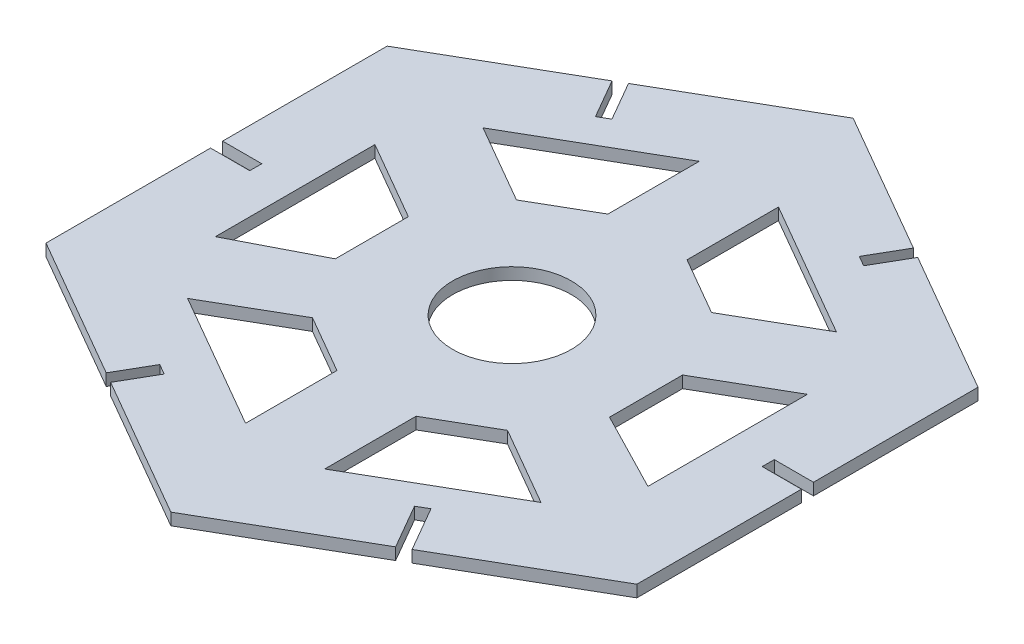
ISO-10303-21;
HEADER;
FILE_DESCRIPTION(('STEP AP214'),'2;1');
FILE_NAME('part.step','',(''),(''),'','','');
FILE_SCHEMA(('AUTOMOTIVE_DESIGN { 1 0 10303 214 1 1 1 1 }'));
ENDSEC;
DATA;
#1=APPLICATION_CONTEXT('core data for automotive mechanical design processes');
#2=APPLICATION_PROTOCOL_DEFINITION('international standard','automotive_design',2000,#1);
#3=PRODUCT_CONTEXT('',#1,'mechanical');
#4=PRODUCT('Part','Part','',(#3));
#5=PRODUCT_RELATED_PRODUCT_CATEGORY('part','',(#4));
#6=PRODUCT_DEFINITION_FORMATION('','',#4);
#7=PRODUCT_DEFINITION_CONTEXT('part definition',#1,'design');
#8=PRODUCT_DEFINITION('design','',#6,#7);
#9=PRODUCT_DEFINITION_SHAPE('','',#8);
#10=(LENGTH_UNIT() NAMED_UNIT(*) SI_UNIT(.MILLI.,.METRE.));
#11=(NAMED_UNIT(*) PLANE_ANGLE_UNIT() SI_UNIT($,.RADIAN.));
#12=(NAMED_UNIT(*) SI_UNIT($,.STERADIAN.) SOLID_ANGLE_UNIT());
#13=UNCERTAINTY_MEASURE_WITH_UNIT(LENGTH_MEASURE(1.E-05),#10,'distance_accuracy_value','');
#14=(GEOMETRIC_REPRESENTATION_CONTEXT(3) GLOBAL_UNCERTAINTY_ASSIGNED_CONTEXT((#13)) GLOBAL_UNIT_ASSIGNED_CONTEXT((#10,
#11,#12)) REPRESENTATION_CONTEXT('',''));
#15=CARTESIAN_POINT('',(0.,0.,0.));
#16=DIRECTION('',(0.,0.,1.));
#17=DIRECTION('',(1.,0.,0.));
#18=AXIS2_PLACEMENT_3D('',#15,#16,#17);
#19=CARTESIAN_POINT('',(4.07292426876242,3.,7.05451176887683));
#20=DIRECTION('',(-0.5,0.,-0.866025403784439));
#21=DIRECTION('',(-0.866025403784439,0.,0.5));
#22=AXIS2_PLACEMENT_3D('',#19,#20,#21);
#23=PLANE('',#22);
#24=DIRECTION('',(0.866025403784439,0.,-0.5));
#25=VECTOR('',#24,1.);
#26=CARTESIAN_POINT('',(4.07292426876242,0.,7.05451176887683));
#27=LINE('',#26,#25);
#28=CARTESIAN_POINT('',(-44.6410161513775,0.,35.179518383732));
#29=VERTEX_POINT('',#28);
#30=CARTESIAN_POINT('',(-24.6410161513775,0.,23.6325129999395));
#31=VERTEX_POINT('',#30);
#32=EDGE_CURVE('E215',#29,#31,#27,.T.);
#33=ORIENTED_EDGE('',*,*,#32,.T.);
#34=DIRECTION('',(0.,-1.,0.));
#35=VECTOR('',#34,1.);
#36=CARTESIAN_POINT('',(-24.6410161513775,3.,23.6325129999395));
#37=LINE('',#36,#35);
#38=CARTESIAN_POINT('',(-24.6410161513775,3.,23.6325129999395));
#39=VERTEX_POINT('',#38);
#40=EDGE_CURVE('E11',#39,#31,#37,.T.);
#41=ORIENTED_EDGE('',*,*,#40,.F.);
#42=DIRECTION('',(0.866025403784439,0.,-0.5));
#43=VECTOR('',#42,1.);
#44=CARTESIAN_POINT('',(4.07292426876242,3.,7.05451176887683));
#45=LINE('',#44,#43);
#46=CARTESIAN_POINT('',(-44.6410161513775,3.,35.179518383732));
#47=VERTEX_POINT('',#46);
#48=EDGE_CURVE('E51',#47,#39,#45,.T.);
#49=ORIENTED_EDGE('',*,*,#48,.F.);
#50=DIRECTION('',(0.,-1.,0.));
#51=VECTOR('',#50,1.);
#52=CARTESIAN_POINT('',(-44.6410161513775,3.,35.179518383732));
#53=LINE('',#52,#51);
#54=EDGE_CURVE('E117',#47,#29,#53,.T.);
#55=ORIENTED_EDGE('',*,*,#54,.T.);
#56=EDGE_LOOP('',(#33,#41,#49,#55));
#57=FACE_BOUND('',#56,.T.);
#58=ADVANCED_FACE('F35',(#57),#23,.F.);
#59=CARTESIAN_POINT('',(-16.3934323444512,3.,28.3942577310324));
#60=DIRECTION('',(0.500000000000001,0.,-0.866025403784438));
#61=DIRECTION('',(-0.866025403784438,0.,-0.500000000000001));
#62=AXIS2_PLACEMENT_3D('',#59,#60,#61);
#63=PLANE('',#62);
#64=DIRECTION('',(0.866025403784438,0.,0.500000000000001));
#65=VECTOR('',#64,1.);
#66=CARTESIAN_POINT('',(-16.3934323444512,0.,28.3942577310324));
#67=LINE('',#66,#65);
#68=CARTESIAN_POINT('',(-9.99999999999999,0.,32.085507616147));
#69=VERTEX_POINT('',#68);
#70=EDGE_CURVE('E217',#31,#69,#67,.T.);
#71=ORIENTED_EDGE('',*,*,#70,.T.);
#72=DIRECTION('',(0.,-1.,0.));
#73=VECTOR('',#72,1.);
#74=CARTESIAN_POINT('',(-9.99999999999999,3.,32.085507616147));
#75=LINE('',#74,#73);
#76=CARTESIAN_POINT('',(-9.99999999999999,3.,32.085507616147));
#77=VERTEX_POINT('',#76);
#78=EDGE_CURVE('E43',#77,#69,#75,.T.);
#79=ORIENTED_EDGE('',*,*,#78,.F.);
#80=DIRECTION('',(0.866025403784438,0.,0.500000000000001));
#81=VECTOR('',#80,1.);
#82=CARTESIAN_POINT('',(-16.3934323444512,3.,28.3942577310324));
#83=LINE('',#82,#81);
#84=EDGE_CURVE('E125',#39,#77,#83,.T.);
#85=ORIENTED_EDGE('',*,*,#84,.F.);
#86=ORIENTED_EDGE('',*,*,#40,.T.);
#87=EDGE_LOOP('',(#71,#79,#85,#86));
#88=FACE_BOUND('',#87,.T.);
#89=ADVANCED_FACE('F316',(#88),#63,.F.);
#90=CARTESIAN_POINT('',(-9.99999999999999,3.,0.));
#91=DIRECTION('',(-1.,0.,0.));
#92=DIRECTION('',(0.,0.,1.));
#93=AXIS2_PLACEMENT_3D('',#90,#91,#92);
#94=PLANE('',#93);
#95=DIRECTION('',(0.,0.,-1.));
#96=VECTOR('',#95,1.);
#97=CARTESIAN_POINT('',(-9.99999999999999,0.,0.));
#98=LINE('',#97,#96);
#99=CARTESIAN_POINT('',(-9.99999999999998,0.,55.179518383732));
#100=VERTEX_POINT('',#99);
#101=EDGE_CURVE('E221',#100,#69,#98,.T.);
#102=ORIENTED_EDGE('',*,*,#101,.F.);
#103=DIRECTION('',(0.,-1.,0.));
#104=VECTOR('',#103,1.);
#105=CARTESIAN_POINT('',(-9.99999999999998,3.,55.179518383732));
#106=LINE('',#105,#104);
#107=CARTESIAN_POINT('',(-9.99999999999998,3.,55.179518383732));
#108=VERTEX_POINT('',#107);
#109=EDGE_CURVE('E309',#108,#100,#106,.T.);
#110=ORIENTED_EDGE('',*,*,#109,.F.);
#111=DIRECTION('',(0.,0.,-1.));
#112=VECTOR('',#111,1.);
#113=CARTESIAN_POINT('',(-9.99999999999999,3.,0.));
#114=LINE('',#113,#112);
#115=EDGE_CURVE('E315',#108,#77,#114,.T.);
#116=ORIENTED_EDGE('',*,*,#115,.T.);
#117=ORIENTED_EDGE('',*,*,#78,.T.);
#118=EDGE_LOOP('',(#102,#110,#116,#117));
#119=FACE_BOUND('',#118,.T.);
#120=ADVANCED_FACE('F313',(#119),#94,.T.);
#121=CARTESIAN_POINT('',(10.,3.,0.));
#122=DIRECTION('',(1.,0.,0.));
#123=DIRECTION('',(0.,0.,-1.));
#124=AXIS2_PLACEMENT_3D('',#121,#122,#123);
#125=PLANE('',#124);
#126=DIRECTION('',(0.,0.,1.));
#127=VECTOR('',#126,1.);
#128=CARTESIAN_POINT('',(10.,0.,0.));
#129=LINE('',#128,#127);
#130=CARTESIAN_POINT('',(10.,0.,32.085507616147));
#131=VERTEX_POINT('',#130);
#132=CARTESIAN_POINT('',(10.,0.,55.179518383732));
#133=VERTEX_POINT('',#132);
#134=EDGE_CURVE('E224',#131,#133,#129,.T.);
#135=ORIENTED_EDGE('',*,*,#134,.F.);
#136=DIRECTION('',(0.,-1.,0.));
#137=VECTOR('',#136,1.);
#138=CARTESIAN_POINT('',(10.,3.,32.085507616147));
#139=LINE('',#138,#137);
#140=CARTESIAN_POINT('',(10.,3.,32.085507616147));
#141=VERTEX_POINT('',#140);
#142=EDGE_CURVE('E304',#141,#131,#139,.T.);
#143=ORIENTED_EDGE('',*,*,#142,.F.);
#144=DIRECTION('',(0.,0.,1.));
#145=VECTOR('',#144,1.);
#146=CARTESIAN_POINT('',(10.,3.,0.));
#147=LINE('',#146,#145);
#148=CARTESIAN_POINT('',(10.,3.,55.179518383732));
#149=VERTEX_POINT('',#148);
#150=EDGE_CURVE('E535',#141,#149,#147,.T.);
#151=ORIENTED_EDGE('',*,*,#150,.T.);
#152=DIRECTION('',(0.,-1.,0.));
#153=VECTOR('',#152,1.);
#154=CARTESIAN_POINT('',(10.,3.,55.179518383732));
#155=LINE('',#154,#153);
#156=EDGE_CURVE('E306',#149,#133,#155,.T.);
#157=ORIENTED_EDGE('',*,*,#156,.T.);
#158=EDGE_LOOP('',(#135,#143,#151,#157));
#159=FACE_BOUND('',#158,.T.);
#160=ADVANCED_FACE('F680',(#159),#125,.T.);
#161=CARTESIAN_POINT('',(16.3934323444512,3.,28.3942577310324));
#162=DIRECTION('',(-0.499999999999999,0.,-0.866025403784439));
#163=DIRECTION('',(-0.866025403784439,0.,0.499999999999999));
#164=AXIS2_PLACEMENT_3D('',#161,#162,#163);
#165=PLANE('',#164);
#166=DIRECTION('',(0.866025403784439,0.,-0.5));
#167=VECTOR('',#166,1.);
#168=CARTESIAN_POINT('',(16.3934323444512,0.,28.3942577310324));
#169=LINE('',#168,#167);
#170=CARTESIAN_POINT('',(24.6410161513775,0.,23.6325129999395));
#171=VERTEX_POINT('',#170);
#172=EDGE_CURVE('E227',#131,#171,#169,.T.);
#173=ORIENTED_EDGE('',*,*,#172,.T.);
#174=DIRECTION('',(0.,-1.,0.));
#175=VECTOR('',#174,1.);
#176=CARTESIAN_POINT('',(24.6410161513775,3.,23.6325129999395));
#177=LINE('',#176,#175);
#178=CARTESIAN_POINT('',(24.6410161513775,3.,23.6325129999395));
#179=VERTEX_POINT('',#178);
#180=EDGE_CURVE('E302',#179,#171,#177,.T.);
#181=ORIENTED_EDGE('',*,*,#180,.F.);
#182=DIRECTION('',(0.866025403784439,0.,-0.5));
#183=VECTOR('',#182,1.);
#184=CARTESIAN_POINT('',(16.3934323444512,3.,28.3942577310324));
#185=LINE('',#184,#183);
#186=EDGE_CURVE('E537',#141,#179,#185,.T.);
#187=ORIENTED_EDGE('',*,*,#186,.F.);
#188=ORIENTED_EDGE('',*,*,#142,.T.);
#189=EDGE_LOOP('',(#173,#181,#187,#188));
#190=FACE_BOUND('',#189,.T.);
#191=ADVANCED_FACE('F688',(#190),#165,.F.);
#192=CARTESIAN_POINT('',(-4.07292426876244,3.,7.05451176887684));
#193=DIRECTION('',(-0.500000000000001,0.,0.866025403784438));
#194=DIRECTION('',(0.866025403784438,0.,0.500000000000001));
#195=AXIS2_PLACEMENT_3D('',#192,#193,#194);
#196=PLANE('',#195);
#197=DIRECTION('',(-0.866025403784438,0.,-0.500000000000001));
#198=VECTOR('',#197,1.);
#199=CARTESIAN_POINT('',(-4.07292426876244,0.,7.05451176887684));
#200=LINE('',#199,#198);
#201=CARTESIAN_POINT('',(44.6410161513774,0.,35.1795183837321));
#202=VERTEX_POINT('',#201);
#203=EDGE_CURVE('E230',#202,#171,#200,.T.);
#204=ORIENTED_EDGE('',*,*,#203,.F.);
#205=DIRECTION('',(0.,-1.,0.));
#206=VECTOR('',#205,1.);
#207=CARTESIAN_POINT('',(44.6410161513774,3.,35.1795183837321));
#208=LINE('',#207,#206);
#209=CARTESIAN_POINT('',(44.6410161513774,3.,35.1795183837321));
#210=VERTEX_POINT('',#209);
#211=EDGE_CURVE('E299',#210,#202,#208,.T.);
#212=ORIENTED_EDGE('',*,*,#211,.F.);
#213=DIRECTION('',(-0.866025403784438,0.,-0.500000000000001));
#214=VECTOR('',#213,1.);
#215=CARTESIAN_POINT('',(-4.07292426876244,3.,7.05451176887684));
#216=LINE('',#215,#214);
#217=EDGE_CURVE('E539',#210,#179,#216,.T.);
#218=ORIENTED_EDGE('',*,*,#217,.T.);
#219=ORIENTED_EDGE('',*,*,#180,.T.);
#220=EDGE_LOOP('',(#204,#212,#218,#219));
#221=FACE_BOUND('',#220,.T.);
#222=ADVANCED_FACE('F684',(#221),#196,.T.);
#223=CARTESIAN_POINT('',(4.06180967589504,3.,-7.88776726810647));
#224=DIRECTION('',(-0.457815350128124,0.,0.889047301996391));
#225=DIRECTION('',(0.889047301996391,0.,0.457815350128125));
#226=AXIS2_PLACEMENT_3D('',#223,#224,#225);
#227=PLANE('',#226);
#228=DIRECTION('',(-0.889047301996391,0.,-0.457815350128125));
#229=VECTOR('',#228,1.);
#230=CARTESIAN_POINT('',(4.06180967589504,0.,-7.88776726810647));
#231=LINE('',#230,#229);
#232=CARTESIAN_POINT('',(54.6410161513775,0.,18.1580202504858));
#233=VERTEX_POINT('',#232);
#234=CARTESIAN_POINT('',(34.6410161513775,0.,7.85901030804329));
#235=VERTEX_POINT('',#234);
#236=EDGE_CURVE('E233',#233,#235,#231,.T.);
#237=ORIENTED_EDGE('',*,*,#236,.T.);
#238=DIRECTION('',(0.,-1.,0.));
#239=VECTOR('',#238,1.);
#240=CARTESIAN_POINT('',(34.6410161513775,3.,7.85901030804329));
#241=LINE('',#240,#239);
#242=CARTESIAN_POINT('',(34.6410161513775,3.,7.85901030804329));
#243=VERTEX_POINT('',#242);
#244=EDGE_CURVE('E293',#243,#235,#241,.T.);
#245=ORIENTED_EDGE('',*,*,#244,.F.);
#246=DIRECTION('',(-0.889047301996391,0.,-0.457815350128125));
#247=VECTOR('',#246,1.);
#248=CARTESIAN_POINT('',(4.06180967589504,3.,-7.88776726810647));
#249=LINE('',#248,#247);
#250=CARTESIAN_POINT('',(54.6410161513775,3.,18.1580202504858));
#251=VERTEX_POINT('',#250);
#252=EDGE_CURVE('E542',#251,#243,#249,.T.);
#253=ORIENTED_EDGE('',*,*,#252,.F.);
#254=DIRECTION('',(0.,-1.,0.));
#255=VECTOR('',#254,1.);
#256=CARTESIAN_POINT('',(54.6410161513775,3.,18.1580202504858));
#257=LINE('',#256,#255);
#258=EDGE_CURVE('E296',#251,#233,#257,.T.);
#259=ORIENTED_EDGE('',*,*,#258,.T.);
#260=EDGE_LOOP('',(#237,#245,#253,#259));
#261=FACE_BOUND('',#260,.T.);
#262=ADVANCED_FACE('F695',(#261),#227,.F.);
#263=CARTESIAN_POINT('',(34.6410161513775,3.,0.));
#264=DIRECTION('',(-1.,0.,0.));
#265=DIRECTION('',(0.,0.,1.));
#266=AXIS2_PLACEMENT_3D('',#263,#264,#265);
#267=PLANE('',#266);
#268=DIRECTION('',(0.,0.,-1.));
#269=VECTOR('',#268,1.);
#270=CARTESIAN_POINT('',(34.6410161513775,0.,0.));
#271=LINE('',#270,#269);
#272=CARTESIAN_POINT('',(34.6410161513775,0.,-10.5939843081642));
#273=VERTEX_POINT('',#272);
#274=EDGE_CURVE('E235',#235,#273,#271,.T.);
#275=ORIENTED_EDGE('',*,*,#274,.T.);
#276=DIRECTION('',(0.,-1.,0.));
#277=VECTOR('',#276,1.);
#278=CARTESIAN_POINT('',(34.6410161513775,3.,-10.5939843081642));
#279=LINE('',#278,#277);
#280=CARTESIAN_POINT('',(34.6410161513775,3.,-10.5939843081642));
#281=VERTEX_POINT('',#280);
#282=EDGE_CURVE('E290',#281,#273,#279,.T.);
#283=ORIENTED_EDGE('',*,*,#282,.F.);
#284=DIRECTION('',(0.,0.,-1.));
#285=VECTOR('',#284,1.);
#286=CARTESIAN_POINT('',(34.6410161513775,3.,0.));
#287=LINE('',#286,#285);
#288=EDGE_CURVE('E544',#243,#281,#287,.T.);
#289=ORIENTED_EDGE('',*,*,#288,.F.);
#290=ORIENTED_EDGE('',*,*,#244,.T.);
#291=EDGE_LOOP('',(#275,#283,#289,#290));
#292=FACE_BOUND('',#291,.T.);
#293=ADVANCED_FACE('F728',(#292),#267,.F.);
#294=CARTESIAN_POINT('',(4.07292426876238,3.,7.05451176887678));
#295=DIRECTION('',(-0.499999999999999,0.,-0.866025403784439));
#296=DIRECTION('',(-0.866025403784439,0.,0.499999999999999));
#297=AXIS2_PLACEMENT_3D('',#294,#295,#296);
#298=PLANE('',#297);
#299=DIRECTION('',(0.86602540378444,0.,-0.499999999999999));
#300=VECTOR('',#299,1.);
#301=CARTESIAN_POINT('',(4.07292426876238,0.,7.05451176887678));
#302=LINE('',#301,#300);
#303=CARTESIAN_POINT('',(54.6410161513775,0.,-22.1409896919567));
#304=VERTEX_POINT('',#303);
#305=EDGE_CURVE('E237',#273,#304,#302,.T.);
#306=ORIENTED_EDGE('',*,*,#305,.T.);
#307=DIRECTION('',(0.,-1.,0.));
#308=VECTOR('',#307,1.);
#309=CARTESIAN_POINT('',(54.6410161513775,3.,-22.1409896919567));
#310=LINE('',#309,#308);
#311=CARTESIAN_POINT('',(54.6410161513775,3.,-22.1409896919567));
#312=VERTEX_POINT('',#311);
#313=EDGE_CURVE('E287',#312,#304,#310,.T.);
#314=ORIENTED_EDGE('',*,*,#313,.F.);
#315=DIRECTION('',(0.86602540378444,0.,-0.499999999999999));
#316=VECTOR('',#315,1.);
#317=CARTESIAN_POINT('',(4.07292426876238,3.,7.05451176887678));
#318=LINE('',#317,#316);
#319=EDGE_CURVE('E546',#281,#312,#318,.T.);
#320=ORIENTED_EDGE('',*,*,#319,.F.);
#321=ORIENTED_EDGE('',*,*,#282,.T.);
#322=EDGE_LOOP('',(#306,#314,#320,#321));
#323=FACE_BOUND('',#322,.T.);
#324=ADVANCED_FACE('F736',(#323),#298,.F.);
#325=CARTESIAN_POINT('',(-5.92707573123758,3.,-10.265996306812));
#326=DIRECTION('',(0.5,0.,0.866025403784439));
#327=DIRECTION('',(0.866025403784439,0.,-0.5));
#328=AXIS2_PLACEMENT_3D('',#325,#326,#327);
#329=PLANE('',#328);
#330=DIRECTION('',(-0.866025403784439,0.,0.5));
#331=VECTOR('',#330,1.);
#332=CARTESIAN_POINT('',(-5.92707573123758,0.,-10.265996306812));
#333=LINE('',#332,#331);
#334=CARTESIAN_POINT('',(44.6410161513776,0.,-39.4614977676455));
#335=VERTEX_POINT('',#334);
#336=CARTESIAN_POINT('',(24.6410161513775,0.,-27.914492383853));
#337=VERTEX_POINT('',#336);
#338=EDGE_CURVE('E239',#335,#337,#333,.T.);
#339=ORIENTED_EDGE('',*,*,#338,.T.);
#340=DIRECTION('',(0.,-1.,0.));
#341=VECTOR('',#340,1.);
#342=CARTESIAN_POINT('',(24.6410161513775,3.,-27.914492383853));
#343=LINE('',#342,#341);
#344=CARTESIAN_POINT('',(24.6410161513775,3.,-27.914492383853));
#345=VERTEX_POINT('',#344);
#346=EDGE_CURVE('E281',#345,#337,#343,.T.);
#347=ORIENTED_EDGE('',*,*,#346,.F.);
#348=DIRECTION('',(-0.866025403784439,0.,0.5));
#349=VECTOR('',#348,1.);
#350=CARTESIAN_POINT('',(-5.92707573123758,3.,-10.265996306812));
#351=LINE('',#350,#349);
#352=CARTESIAN_POINT('',(44.6410161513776,3.,-39.4614977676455));
#353=VERTEX_POINT('',#352);
#354=EDGE_CURVE('E548',#353,#345,#351,.T.);
#355=ORIENTED_EDGE('',*,*,#354,.F.);
#356=DIRECTION('',(0.,-1.,0.));
#357=VECTOR('',#356,1.);
#358=CARTESIAN_POINT('',(44.6410161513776,3.,-39.4614977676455));
#359=LINE('',#358,#357);
#360=EDGE_CURVE('E284',#353,#335,#359,.T.);
#361=ORIENTED_EDGE('',*,*,#360,.T.);
#362=EDGE_LOOP('',(#339,#347,#355,#361));
#363=FACE_BOUND('',#362,.T.);
#364=ADVANCED_FACE('F741',(#363),#329,.F.);
#365=CARTESIAN_POINT('',(18.2475838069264,3.,-31.6057422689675));
#366=DIRECTION('',(-0.500000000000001,0.,0.866025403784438));
#367=DIRECTION('',(0.866025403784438,0.,0.500000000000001));
#368=AXIS2_PLACEMENT_3D('',#365,#366,#367);
#369=PLANE('',#368);
#370=DIRECTION('',(-0.866025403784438,0.,-0.500000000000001));
#371=VECTOR('',#370,1.);
#372=CARTESIAN_POINT('',(18.2475838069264,0.,-31.6057422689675));
#373=LINE('',#372,#371);
#374=CARTESIAN_POINT('',(10.0000000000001,0.,-36.3674870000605));
#375=VERTEX_POINT('',#374);
#376=EDGE_CURVE('E241',#337,#375,#373,.T.);
#377=ORIENTED_EDGE('',*,*,#376,.T.);
#378=DIRECTION('',(0.,-1.,0.));
#379=VECTOR('',#378,1.);
#380=CARTESIAN_POINT('',(10.0000000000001,3.,-36.3674870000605));
#381=LINE('',#380,#379);
#382=CARTESIAN_POINT('',(10.0000000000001,3.,-36.3674870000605));
#383=VERTEX_POINT('',#382);
#384=EDGE_CURVE('E279',#383,#375,#381,.T.);
#385=ORIENTED_EDGE('',*,*,#384,.F.);
#386=DIRECTION('',(-0.866025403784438,0.,-0.500000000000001));
#387=VECTOR('',#386,1.);
#388=CARTESIAN_POINT('',(18.2475838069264,3.,-31.6057422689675));
#389=LINE('',#388,#387);
#390=EDGE_CURVE('E550',#345,#383,#389,.T.);
#391=ORIENTED_EDGE('',*,*,#390,.F.);
#392=ORIENTED_EDGE('',*,*,#346,.T.);
#393=EDGE_LOOP('',(#377,#385,#391,#392));
#394=FACE_BOUND('',#393,.T.);
#395=ADVANCED_FACE('F752',(#394),#369,.F.);
#396=CARTESIAN_POINT('',(10.0000000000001,3.,0.));
#397=DIRECTION('',(1.,0.,0.));
#398=DIRECTION('',(0.,0.,-1.));
#399=AXIS2_PLACEMENT_3D('',#396,#397,#398);
#400=PLANE('',#399);
#401=DIRECTION('',(0.,0.,1.));
#402=VECTOR('',#401,1.);
#403=CARTESIAN_POINT('',(10.0000000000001,0.,0.));
#404=LINE('',#403,#402);
#405=CARTESIAN_POINT('',(10.0000000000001,0.,-59.4614977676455));
#406=VERTEX_POINT('',#405);
#407=EDGE_CURVE('E244',#406,#375,#404,.T.);
#408=ORIENTED_EDGE('',*,*,#407,.F.);
#409=DIRECTION('',(0.,-1.,0.));
#410=VECTOR('',#409,1.);
#411=CARTESIAN_POINT('',(10.0000000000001,3.,-59.4614977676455));
#412=LINE('',#411,#410);
#413=CARTESIAN_POINT('',(10.0000000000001,3.,-59.4614977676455));
#414=VERTEX_POINT('',#413);
#415=EDGE_CURVE('E276',#414,#406,#412,.T.);
#416=ORIENTED_EDGE('',*,*,#415,.F.);
#417=DIRECTION('',(0.,0.,1.));
#418=VECTOR('',#417,1.);
#419=CARTESIAN_POINT('',(10.0000000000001,3.,0.));
#420=LINE('',#419,#418);
#421=EDGE_CURVE('E552',#414,#383,#420,.T.);
#422=ORIENTED_EDGE('',*,*,#421,.T.);
#423=ORIENTED_EDGE('',*,*,#384,.T.);
#424=EDGE_LOOP('',(#408,#416,#422,#423));
#425=FACE_BOUND('',#424,.T.);
#426=ADVANCED_FACE('F760',(#425),#400,.T.);
#427=CARTESIAN_POINT('',(-9.99999999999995,3.,0.));
#428=DIRECTION('',(1.,0.,0.));
#429=DIRECTION('',(0.,0.,-1.));
#430=AXIS2_PLACEMENT_3D('',#427,#428,#429);
#431=PLANE('',#430);
#432=DIRECTION('',(0.,0.,1.));
#433=VECTOR('',#432,1.);
#434=CARTESIAN_POINT('',(-9.99999999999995,0.,0.));
#435=LINE('',#434,#433);
#436=CARTESIAN_POINT('',(-9.99999999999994,0.,-59.4614977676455));
#437=VERTEX_POINT('',#436);
#438=CARTESIAN_POINT('',(-9.99999999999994,0.,-36.3674870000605));
#439=VERTEX_POINT('',#438);
#440=EDGE_CURVE('E247',#437,#439,#435,.T.);
#441=ORIENTED_EDGE('',*,*,#440,.T.);
#442=DIRECTION('',(0.,-1.,0.));
#443=VECTOR('',#442,1.);
#444=CARTESIAN_POINT('',(-9.99999999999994,3.,-36.3674870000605));
#445=LINE('',#444,#443);
#446=CARTESIAN_POINT('',(-9.99999999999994,3.,-36.3674870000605));
#447=VERTEX_POINT('',#446);
#448=EDGE_CURVE('E270',#447,#439,#445,.T.);
#449=ORIENTED_EDGE('',*,*,#448,.F.);
#450=DIRECTION('',(0.,0.,1.));
#451=VECTOR('',#450,1.);
#452=CARTESIAN_POINT('',(-9.99999999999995,3.,0.));
#453=LINE('',#452,#451);
#454=CARTESIAN_POINT('',(-9.99999999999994,3.,-59.4614977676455));
#455=VERTEX_POINT('',#454);
#456=EDGE_CURVE('E555',#455,#447,#453,.T.);
#457=ORIENTED_EDGE('',*,*,#456,.F.);
#458=DIRECTION('',(0.,-1.,0.));
#459=VECTOR('',#458,1.);
#460=CARTESIAN_POINT('',(-9.99999999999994,3.,-59.4614977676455));
#461=LINE('',#460,#459);
#462=EDGE_CURVE('E273',#455,#437,#461,.T.);
#463=ORIENTED_EDGE('',*,*,#462,.T.);
#464=EDGE_LOOP('',(#441,#449,#457,#463));
#465=FACE_BOUND('',#464,.T.);
#466=ADVANCED_FACE('F662',(#465),#431,.F.);
#467=CARTESIAN_POINT('',(-18.2475838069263,3.,-31.6057422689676));
#468=DIRECTION('',(0.499999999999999,0.,0.866025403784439));
#469=DIRECTION('',(0.866025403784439,0.,-0.499999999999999));
#470=AXIS2_PLACEMENT_3D('',#467,#468,#469);
#471=PLANE('',#470);
#472=DIRECTION('',(-0.866025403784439,0.,0.499999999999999));
#473=VECTOR('',#472,1.);
#474=CARTESIAN_POINT('',(-18.2475838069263,0.,-31.6057422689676));
#475=LINE('',#474,#473);
#476=CARTESIAN_POINT('',(-24.6410161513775,0.,-27.914492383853));
#477=VERTEX_POINT('',#476);
#478=EDGE_CURVE('E249',#439,#477,#475,.T.);
#479=ORIENTED_EDGE('',*,*,#478,.T.);
#480=DIRECTION('',(0.,-1.,0.));
#481=VECTOR('',#480,1.);
#482=CARTESIAN_POINT('',(-24.6410161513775,3.,-27.914492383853));
#483=LINE('',#482,#481);
#484=CARTESIAN_POINT('',(-24.6410161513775,3.,-27.914492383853));
#485=VERTEX_POINT('',#484);
#486=EDGE_CURVE('E268',#485,#477,#483,.T.);
#487=ORIENTED_EDGE('',*,*,#486,.F.);
#488=DIRECTION('',(-0.866025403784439,0.,0.499999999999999));
#489=VECTOR('',#488,1.);
#490=CARTESIAN_POINT('',(-18.2475838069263,3.,-31.6057422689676));
#491=LINE('',#490,#489);
#492=EDGE_CURVE('E557',#447,#485,#491,.T.);
#493=ORIENTED_EDGE('',*,*,#492,.F.);
#494=ORIENTED_EDGE('',*,*,#448,.T.);
#495=EDGE_LOOP('',(#479,#487,#493,#494));
#496=FACE_BOUND('',#495,.T.);
#497=ADVANCED_FACE('F775',(#496),#471,.F.);
#498=CARTESIAN_POINT('',(5.9270757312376,3.,-10.265996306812));
#499=DIRECTION('',(0.500000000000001,0.,-0.866025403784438));
#500=DIRECTION('',(-0.866025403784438,0.,-0.500000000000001));
#501=AXIS2_PLACEMENT_3D('',#498,#499,#500);
#502=PLANE('',#501);
#503=DIRECTION('',(0.866025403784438,0.,0.500000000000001));
#504=VECTOR('',#503,1.);
#505=CARTESIAN_POINT('',(5.9270757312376,0.,-10.265996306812));
#506=LINE('',#505,#504);
#507=CARTESIAN_POINT('',(-44.6410161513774,0.,-39.4614977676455));
#508=VERTEX_POINT('',#507);
#509=EDGE_CURVE('E252',#508,#477,#506,.T.);
#510=ORIENTED_EDGE('',*,*,#509,.F.);
#511=DIRECTION('',(0.,-1.,0.));
#512=VECTOR('',#511,1.);
#513=CARTESIAN_POINT('',(-44.6410161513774,3.,-39.4614977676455));
#514=LINE('',#513,#512);
#515=CARTESIAN_POINT('',(-44.6410161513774,3.,-39.4614977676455));
#516=VERTEX_POINT('',#515);
#517=EDGE_CURVE('E265',#516,#508,#514,.T.);
#518=ORIENTED_EDGE('',*,*,#517,.F.);
#519=DIRECTION('',(0.866025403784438,0.,0.500000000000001));
#520=VECTOR('',#519,1.);
#521=CARTESIAN_POINT('',(5.9270757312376,3.,-10.265996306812));
#522=LINE('',#521,#520);
#523=EDGE_CURVE('E559',#516,#485,#522,.T.);
#524=ORIENTED_EDGE('',*,*,#523,.T.);
#525=ORIENTED_EDGE('',*,*,#486,.T.);
#526=EDGE_LOOP('',(#510,#518,#524,#525));
#527=FACE_BOUND('',#526,.T.);
#528=ADVANCED_FACE('F782',(#527),#502,.T.);
#529=CARTESIAN_POINT('',(-4.07292426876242,3.,7.05451176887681));
#530=DIRECTION('',(-0.500000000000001,0.,0.866025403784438));
#531=DIRECTION('',(0.866025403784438,0.,0.500000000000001));
#532=AXIS2_PLACEMENT_3D('',#529,#530,#531);
#533=PLANE('',#532);
#534=DIRECTION('',(-0.866025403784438,0.,-0.500000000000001));
#535=VECTOR('',#534,1.);
#536=CARTESIAN_POINT('',(-4.07292426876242,0.,7.05451176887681));
#537=LINE('',#536,#535);
#538=CARTESIAN_POINT('',(-34.6410161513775,0.,-10.5939843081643));
#539=VERTEX_POINT('',#538);
#540=CARTESIAN_POINT('',(-54.6410161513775,0.,-22.1409896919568));
#541=VERTEX_POINT('',#540);
#542=EDGE_CURVE('E255',#539,#541,#537,.T.);
#543=ORIENTED_EDGE('',*,*,#542,.F.);
#544=DIRECTION('',(0.,-1.,0.));
#545=VECTOR('',#544,1.);
#546=CARTESIAN_POINT('',(-34.6410161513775,3.,-10.5939843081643));
#547=LINE('',#546,#545);
#548=CARTESIAN_POINT('',(-34.6410161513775,3.,-10.5939843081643));
#549=VERTEX_POINT('',#548);
#550=EDGE_CURVE('E207',#549,#539,#547,.T.);
#551=ORIENTED_EDGE('',*,*,#550,.F.);
#552=DIRECTION('',(-0.866025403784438,0.,-0.500000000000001));
#553=VECTOR('',#552,1.);
#554=CARTESIAN_POINT('',(-4.07292426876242,3.,7.05451176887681));
#555=LINE('',#554,#553);
#556=CARTESIAN_POINT('',(-54.6410161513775,3.,-22.1409896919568));
#557=VERTEX_POINT('',#556);
#558=EDGE_CURVE('E199',#549,#557,#555,.T.);
#559=ORIENTED_EDGE('',*,*,#558,.T.);
#560=DIRECTION('',(0.,-1.,0.));
#561=VECTOR('',#560,1.);
#562=CARTESIAN_POINT('',(-54.6410161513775,3.,-22.1409896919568));
#563=LINE('',#562,#561);
#564=EDGE_CURVE('E262',#557,#541,#563,.T.);
#565=ORIENTED_EDGE('',*,*,#564,.T.);
#566=EDGE_LOOP('',(#543,#551,#559,#565));
#567=FACE_BOUND('',#566,.T.);
#568=ADVANCED_FACE('F564',(#567),#533,.T.);
#569=CARTESIAN_POINT('',(-34.6410161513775,3.,0.));
#570=DIRECTION('',(1.,0.,0.));
#571=DIRECTION('',(0.,0.,-1.));
#572=AXIS2_PLACEMENT_3D('',#569,#570,#571);
#573=PLANE('',#572);
#574=DIRECTION('',(0.,0.,1.));
#575=VECTOR('',#574,1.);
#576=CARTESIAN_POINT('',(-34.6410161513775,0.,0.));
#577=LINE('',#576,#575);
#578=CARTESIAN_POINT('',(-34.6410161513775,0.,7.85901030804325));
#579=VERTEX_POINT('',#578);
#580=EDGE_CURVE('E206',#539,#579,#577,.T.);
#581=ORIENTED_EDGE('',*,*,#580,.T.);
#582=DIRECTION('',(0.,-1.,0.));
#583=VECTOR('',#582,1.);
#584=CARTESIAN_POINT('',(-34.6410161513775,3.,7.85901030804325));
#585=LINE('',#584,#583);
#586=CARTESIAN_POINT('',(-34.6410161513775,3.,7.85901030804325));
#587=VERTEX_POINT('',#586);
#588=EDGE_CURVE('E203',#587,#579,#585,.T.);
#589=ORIENTED_EDGE('',*,*,#588,.F.);
#590=DIRECTION('',(0.,0.,1.));
#591=VECTOR('',#590,1.);
#592=CARTESIAN_POINT('',(-34.6410161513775,3.,0.));
#593=LINE('',#592,#591);
#594=EDGE_CURVE('E191',#549,#587,#593,.T.);
#595=ORIENTED_EDGE('',*,*,#594,.F.);
#596=ORIENTED_EDGE('',*,*,#550,.T.);
#597=EDGE_LOOP('',(#581,#589,#595,#596));
#598=FACE_BOUND('',#597,.T.);
#599=ADVANCED_FACE('F204',(#598),#573,.F.);
#600=CARTESIAN_POINT('',(-4.06180967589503,3.,-7.88776726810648));
#601=DIRECTION('',(-0.457815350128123,0.,-0.889047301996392));
#602=DIRECTION('',(-0.889047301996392,0.,0.457815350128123));
#603=AXIS2_PLACEMENT_3D('',#600,#601,#602);
#604=PLANE('',#603);
#605=DIRECTION('',(0.889047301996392,0.,-0.457815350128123));
#606=VECTOR('',#605,1.);
#607=CARTESIAN_POINT('',(-4.06180967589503,0.,-7.88776726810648));
#608=LINE('',#607,#606);
#609=CARTESIAN_POINT('',(-54.6410161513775,0.,18.1580202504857));
#610=VERTEX_POINT('',#609);
#611=EDGE_CURVE('E113',#610,#579,#608,.T.);
#612=ORIENTED_EDGE('',*,*,#611,.F.);
#613=DIRECTION('',(0.,-1.,0.));
#614=VECTOR('',#613,1.);
#615=CARTESIAN_POINT('',(-54.6410161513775,3.,18.1580202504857));
#616=LINE('',#615,#614);
#617=CARTESIAN_POINT('',(-54.6410161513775,3.,18.1580202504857));
#618=VERTEX_POINT('',#617);
#619=EDGE_CURVE('E208',#618,#610,#616,.T.);
#620=ORIENTED_EDGE('',*,*,#619,.F.);
#621=DIRECTION('',(0.889047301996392,0.,-0.457815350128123));
#622=VECTOR('',#621,1.);
#623=CARTESIAN_POINT('',(-4.06180967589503,3.,-7.88776726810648));
#624=LINE('',#623,#622);
#625=EDGE_CURVE('E197',#618,#587,#624,.T.);
#626=ORIENTED_EDGE('',*,*,#625,.T.);
#627=ORIENTED_EDGE('',*,*,#588,.T.);
#628=EDGE_LOOP('',(#612,#620,#626,#627));
#629=FACE_BOUND('',#628,.T.);
#630=ADVANCED_FACE('F210',(#629),#604,.T.);
#631=CARTESIAN_POINT('',(0.,3.,0.));
#632=DIRECTION('',(0.,1.,0.));
#633=DIRECTION('',(0.,0.,1.));
#634=AXIS2_PLACEMENT_3D('',#631,#632,#633);
#635=PLANE('',#634);
#636=CARTESIAN_POINT('',(0.,3.,-2.1409896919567));
#637=DIRECTION('',(0.,1.,0.));
#638=DIRECTION('',(0.,0.,1.));
#639=AXIS2_PLACEMENT_3D('',#636,#637,#638);
#640=CIRCLE('',#639,15.);
#641=CARTESIAN_POINT('',(0.,3.,12.8590103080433));
#642=VERTEX_POINT('',#641);
#643=EDGE_CURVE('E628',#642,#642,#640,.T.);
#644=ORIENTED_EDGE('',*,*,#643,.F.);
#645=EDGE_LOOP('',(#644));
#646=FACE_BOUND('',#645,.T.);
#647=DIRECTION('',(0.866025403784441,0.,0.499999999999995));
#648=VECTOR('',#647,1.);
#649=CARTESIAN_POINT('',(-26.393432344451,3.,45.7147658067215));
#650=LINE('',#649,#648);
#651=EDGE_CURVE('E426',#47,#108,#650,.T.);
#652=ORIENTED_EDGE('',*,*,#651,.F.);
#653=ORIENTED_EDGE('',*,*,#48,.T.);
#654=ORIENTED_EDGE('',*,*,#84,.T.);
#655=ORIENTED_EDGE('',*,*,#115,.F.);
#656=EDGE_LOOP('',(#652,#653,#654,#655));
#657=FACE_BOUND('',#656,.T.);
#658=DIRECTION('',(0.866025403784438,0.,-0.500000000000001));
#659=VECTOR('',#658,1.);
#660=CARTESIAN_POINT('',(26.3934323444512,3.,45.7147658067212));
#661=LINE('',#660,#659);
#662=EDGE_CURVE('E440',#149,#210,#661,.T.);
#663=ORIENTED_EDGE('',*,*,#662,.F.);
#664=ORIENTED_EDGE('',*,*,#150,.F.);
#665=ORIENTED_EDGE('',*,*,#186,.T.);
#666=ORIENTED_EDGE('',*,*,#217,.F.);
#667=EDGE_LOOP('',(#663,#664,#665,#666));
#668=FACE_BOUND('',#667,.T.);
#669=DIRECTION('',(0.,0.,-1.));
#670=VECTOR('',#669,1.);
#671=CARTESIAN_POINT('',(54.6410161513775,3.,0.));
#672=LINE('',#671,#670);
#673=EDGE_CURVE('E437',#251,#312,#672,.T.);
#674=ORIENTED_EDGE('',*,*,#673,.F.);
#675=ORIENTED_EDGE('',*,*,#252,.T.);
#676=ORIENTED_EDGE('',*,*,#288,.T.);
#677=ORIENTED_EDGE('',*,*,#319,.T.);
#678=EDGE_LOOP('',(#674,#675,#676,#677));
#679=FACE_BOUND('',#678,.T.);
#680=DIRECTION('',(-0.866025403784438,0.,-0.500000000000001));
#681=VECTOR('',#680,1.);
#682=CARTESIAN_POINT('',(28.2475838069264,3.,-48.9262503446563));
#683=LINE('',#682,#681);
#684=EDGE_CURVE('E434',#353,#414,#683,.T.);
#685=ORIENTED_EDGE('',*,*,#684,.F.);
#686=ORIENTED_EDGE('',*,*,#354,.T.);
#687=ORIENTED_EDGE('',*,*,#390,.T.);
#688=ORIENTED_EDGE('',*,*,#421,.F.);
#689=EDGE_LOOP('',(#685,#686,#687,#688));
#690=FACE_BOUND('',#689,.T.);
#691=DIRECTION('',(-0.866025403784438,0.,0.500000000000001));
#692=VECTOR('',#691,1.);
#693=CARTESIAN_POINT('',(-28.2475838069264,3.,-48.9262503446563));
#694=LINE('',#693,#692);
#695=EDGE_CURVE('E431',#455,#516,#694,.T.);
#696=ORIENTED_EDGE('',*,*,#695,.F.);
#697=ORIENTED_EDGE('',*,*,#456,.T.);
#698=ORIENTED_EDGE('',*,*,#492,.T.);
#699=ORIENTED_EDGE('',*,*,#523,.F.);
#700=EDGE_LOOP('',(#696,#697,#698,#699));
#701=FACE_BOUND('',#700,.T.);
#702=DIRECTION('',(0.,0.,1.));
#703=VECTOR('',#702,1.);
#704=CARTESIAN_POINT('',(-54.6410161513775,3.,0.));
#705=LINE('',#704,#703);
#706=EDGE_CURVE('E429',#557,#618,#705,.T.);
#707=ORIENTED_EDGE('',*,*,#706,.F.);
#708=ORIENTED_EDGE('',*,*,#558,.F.);
#709=ORIENTED_EDGE('',*,*,#594,.T.);
#710=ORIENTED_EDGE('',*,*,#625,.F.);
#711=EDGE_LOOP('',(#707,#708,#709,#710));
#712=FACE_BOUND('',#711,.T.);
#713=DIRECTION('',(0.,0.,-1.));
#714=VECTOR('',#713,1.);
#715=CARTESIAN_POINT('',(-64.7350161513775,3.,0.));
#716=LINE('',#715,#714);
#717=CARTESIAN_POINT('',(-64.7350161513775,3.,-0.616989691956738));
#718=VERTEX_POINT('',#717);
#719=CARTESIAN_POINT('',(-64.7350161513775,3.,-3.66498969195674));
#720=VERTEX_POINT('',#719);
#721=EDGE_CURVE('E347',#718,#720,#716,.T.);
#722=ORIENTED_EDGE('',*,*,#721,.F.);
#723=DIRECTION('',(1.,0.,0.));
#724=VECTOR('',#723,1.);
#725=CARTESIAN_POINT('',(0.,3.,-0.616989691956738));
#726=LINE('',#725,#724);
#727=CARTESIAN_POINT('',(-74.6410161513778,3.,-0.616989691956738));
#728=VERTEX_POINT('',#727);
#729=EDGE_CURVE('E350',#728,#718,#726,.T.);
#730=ORIENTED_EDGE('',*,*,#729,.F.);
#731=DIRECTION('',(0.,0.,1.));
#732=VECTOR('',#731,1.);
#733=CARTESIAN_POINT('',(-74.6410161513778,3.,0.));
#734=LINE('',#733,#732);
#735=CARTESIAN_POINT('',(-74.6410161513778,3.,40.9530210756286));
#736=VERTEX_POINT('',#735);
#737=EDGE_CURVE('E354',#728,#736,#734,.T.);
#738=ORIENTED_EDGE('',*,*,#737,.T.);
#739=DIRECTION('',(0.866025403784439,0.,0.5));
#740=VECTOR('',#739,1.);
#741=CARTESIAN_POINT('',(-36.3934323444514,3.,63.0352738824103));
#742=LINE('',#741,#740);
#743=CARTESIAN_POINT('',(-38.6403307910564,3.,61.7380264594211));
#744=VERTEX_POINT('',#743);
#745=EDGE_CURVE('E357',#736,#744,#742,.T.);
#746=ORIENTED_EDGE('',*,*,#745,.T.);
#747=DIRECTION('',(0.499999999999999,0.,-0.866025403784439));
#748=VECTOR('',#747,1.);
#749=CARTESIAN_POINT('',(-2.24689844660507,3.,-1.29724742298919));
#750=LINE('',#749,#748);
#751=CARTESIAN_POINT('',(-33.6873307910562,3.,53.1591788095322));
#752=VERTEX_POINT('',#751);
#753=EDGE_CURVE('E361',#744,#752,#750,.T.);
#754=ORIENTED_EDGE('',*,*,#753,.T.);
#755=DIRECTION('',(0.86602540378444,0.,0.499999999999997));
#756=VECTOR('',#755,1.);
#757=CARTESIAN_POINT('',(-31.440432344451,3.,54.4564262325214));
#758=LINE('',#757,#756);
#759=CARTESIAN_POINT('',(-31.0476853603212,3.,54.6831788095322));
#760=VERTEX_POINT('',#759);
#761=EDGE_CURVE('E365',#752,#760,#758,.T.);
#762=ORIENTED_EDGE('',*,*,#761,.T.);
#763=DIRECTION('',(0.499999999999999,0.,-0.86602540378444));
#764=VECTOR('',#763,1.);
#765=CARTESIAN_POINT('',(0.392746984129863,3.,0.226752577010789));
#766=LINE('',#765,#764);
#767=CARTESIAN_POINT('',(-36.0006853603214,3.,63.2620264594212));
#768=VERTEX_POINT('',#767);
#769=EDGE_CURVE('E368',#768,#760,#766,.T.);
#770=ORIENTED_EDGE('',*,*,#769,.F.);
#771=CARTESIAN_POINT('',(-3.53883589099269E-13,3.,84.0470318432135));
#772=VERTEX_POINT('',#771);
#773=EDGE_CURVE('E362',#768,#772,#742,.T.);
#774=ORIENTED_EDGE('',*,*,#773,.T.);
#775=DIRECTION('',(0.866025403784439,0.,-0.5));
#776=VECTOR('',#775,1.);
#777=CARTESIAN_POINT('',(36.3934323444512,3.,63.03527388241));
#778=LINE('',#777,#776);
#779=CARTESIAN_POINT('',(36.0006853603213,3.,63.2620264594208));
#780=VERTEX_POINT('',#779);
#781=EDGE_CURVE('E371',#772,#780,#778,.T.);
#782=ORIENTED_EDGE('',*,*,#781,.T.);
#783=DIRECTION('',(-0.5,0.,-0.866025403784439));
#784=VECTOR('',#783,1.);
#785=CARTESIAN_POINT('',(-0.392746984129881,3.,0.226752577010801));
#786=LINE('',#785,#784);
#787=CARTESIAN_POINT('',(29.4846383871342,3.,51.9759020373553));
#788=VERTEX_POINT('',#787);
#789=EDGE_CURVE('E374',#780,#788,#786,.T.);
#790=ORIENTED_EDGE('',*,*,#789,.T.);
#791=DIRECTION('',(-0.866025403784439,0.,0.5));
#792=VECTOR('',#791,1.);
#793=CARTESIAN_POINT('',(29.877385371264,3.,51.7491494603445));
#794=LINE('',#793,#792);
#795=CARTESIAN_POINT('',(32.1242838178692,3.,50.4519020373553));
#796=VERTEX_POINT('',#795);
#797=EDGE_CURVE('E378',#796,#788,#794,.T.);
#798=ORIENTED_EDGE('',*,*,#797,.F.);
#799=DIRECTION('',(-0.5,0.,-0.866025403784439));
#800=VECTOR('',#799,1.);
#801=CARTESIAN_POINT('',(2.24689844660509,3.,-1.2972474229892));
#802=LINE('',#801,#800);
#803=CARTESIAN_POINT('',(38.6403307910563,3.,61.7380264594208));
#804=VERTEX_POINT('',#803);
#805=EDGE_CURVE('E381',#804,#796,#802,.T.);
#806=ORIENTED_EDGE('',*,*,#805,.F.);
#807=CARTESIAN_POINT('',(74.6410161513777,3.,40.9530210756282));
#808=VERTEX_POINT('',#807);
#809=EDGE_CURVE('E375',#804,#808,#778,.T.);
#810=ORIENTED_EDGE('',*,*,#809,.T.);
#811=DIRECTION('',(0.,0.,-1.));
#812=VECTOR('',#811,1.);
#813=CARTESIAN_POINT('',(74.6410161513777,3.,0.));
#814=LINE('',#813,#812);
#815=CARTESIAN_POINT('',(74.6410161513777,3.,-0.616989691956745));
#816=VERTEX_POINT('',#815);
#817=EDGE_CURVE('E384',#808,#816,#814,.T.);
#818=ORIENTED_EDGE('',*,*,#817,.T.);
#819=DIRECTION('',(-1.,0.,0.));
#820=VECTOR('',#819,1.);
#821=CARTESIAN_POINT('',(0.,3.,-0.616989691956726));
#822=LINE('',#821,#820);
#823=CARTESIAN_POINT('',(64.7350161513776,3.,-0.616989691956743));
#824=VERTEX_POINT('',#823);
#825=EDGE_CURVE('E387',#816,#824,#822,.T.);
#826=ORIENTED_EDGE('',*,*,#825,.T.);
#827=DIRECTION('',(0.,0.,-1.));
#828=VECTOR('',#827,1.);
#829=CARTESIAN_POINT('',(64.7350161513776,3.,0.));
#830=LINE('',#829,#828);
#831=CARTESIAN_POINT('',(64.7350161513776,3.,-3.66498969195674));
#832=VERTEX_POINT('',#831);
#833=EDGE_CURVE('E391',#824,#832,#830,.T.);
#834=ORIENTED_EDGE('',*,*,#833,.T.);
#835=DIRECTION('',(-1.,0.,0.));
#836=VECTOR('',#835,1.);
#837=CARTESIAN_POINT('',(0.,3.,-3.66498969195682));
#838=LINE('',#837,#836);
#839=CARTESIAN_POINT('',(74.6410161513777,3.,-3.66498969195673));
#840=VERTEX_POINT('',#839);
#841=EDGE_CURVE('E394',#840,#832,#838,.T.);
#842=ORIENTED_EDGE('',*,*,#841,.F.);
#843=CARTESIAN_POINT('',(74.6410161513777,3.,-45.2350004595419));
#844=VERTEX_POINT('',#843);
#845=EDGE_CURVE('E388',#840,#844,#814,.T.);
#846=ORIENTED_EDGE('',*,*,#845,.T.);
#847=DIRECTION('',(-0.866025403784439,0.,-0.5));
#848=VECTOR('',#847,1.);
#849=CARTESIAN_POINT('',(38.2475838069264,3.,-66.2467584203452));
#850=LINE('',#849,#848);
#851=CARTESIAN_POINT('',(38.6195461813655,3.,-66.0320058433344));
#852=VERTEX_POINT('',#851);
#853=EDGE_CURVE('E397',#844,#852,#850,.T.);
#854=ORIENTED_EDGE('',*,*,#853,.T.);
#855=DIRECTION('',(-0.5,0.,0.866025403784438));
#856=VECTOR('',#855,1.);
#857=CARTESIAN_POINT('',(0.3719623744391,3.,0.214752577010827));
#858=LINE('',#857,#856);
#859=CARTESIAN_POINT('',(33.6195461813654,3.,-57.3717518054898));
#860=VERTEX_POINT('',#859);
#861=EDGE_CURVE('E400',#852,#860,#858,.T.);
#862=ORIENTED_EDGE('',*,*,#861,.T.);
#863=DIRECTION('',(0.866025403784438,0.,0.500000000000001));
#864=VECTOR('',#863,1.);
#865=CARTESIAN_POINT('',(33.2475838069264,3.,-57.5865043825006));
#866=LINE('',#865,#864);
#867=CARTESIAN_POINT('',(31.0214699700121,3.,-58.8717518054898));
#868=VERTEX_POINT('',#867);
#869=EDGE_CURVE('E404',#868,#860,#866,.T.);
#870=ORIENTED_EDGE('',*,*,#869,.F.);
#871=DIRECTION('',(-0.5,0.,0.866025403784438));
#872=VECTOR('',#871,1.);
#873=CARTESIAN_POINT('',(-2.22611383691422,3.,-1.28524742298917));
#874=LINE('',#873,#872);
#875=CARTESIAN_POINT('',(36.0214699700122,3.,-67.5320058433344));
#876=VERTEX_POINT('',#875);
#877=EDGE_CURVE('E407',#876,#868,#874,.T.);
#878=ORIENTED_EDGE('',*,*,#877,.F.);
#879=CARTESIAN_POINT('',(1.59594559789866E-13,3.,-88.3290112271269));
#880=VERTEX_POINT('',#879);
#881=EDGE_CURVE('E401',#876,#880,#850,.T.);
#882=ORIENTED_EDGE('',*,*,#881,.T.);
#883=DIRECTION('',(-0.866025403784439,0.,0.5));
#884=VECTOR('',#883,1.);
#885=CARTESIAN_POINT('',(-38.2475838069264,3.,-66.2467584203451));
#886=LINE('',#885,#884);
#887=CARTESIAN_POINT('',(-35.9799007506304,3.,-67.5560058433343));
#888=VERTEX_POINT('',#887);
#889=EDGE_CURVE('E410',#880,#888,#886,.T.);
#890=ORIENTED_EDGE('',*,*,#889,.T.);
#891=DIRECTION('',(0.500000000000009,0.,0.866025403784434));
#892=VECTOR('',#891,1.);
#893=CARTESIAN_POINT('',(2.26768305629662,3.,-1.30924742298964));
#894=LINE('',#893,#892);
#895=CARTESIAN_POINT('',(-30.2606689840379,3.,-57.6500058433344));
#896=VERTEX_POINT('',#895);
#897=EDGE_CURVE('E413',#888,#896,#894,.T.);
#898=ORIENTED_EDGE('',*,*,#897,.T.);
#899=DIRECTION('',(0.866025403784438,0.,-0.500000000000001));
#900=VECTOR('',#899,1.);
#901=CARTESIAN_POINT('',(-32.528352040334,3.,-56.340758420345));
#902=LINE('',#901,#900);
#903=CARTESIAN_POINT('',(-32.9003144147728,3.,-56.1260058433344));
#904=VERTEX_POINT('',#903);
#905=EDGE_CURVE('E417',#904,#896,#902,.T.);
#906=ORIENTED_EDGE('',*,*,#905,.F.);
#907=DIRECTION('',(0.500000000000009,0.,0.866025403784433));
#908=VECTOR('',#907,1.);
#909=CARTESIAN_POINT('',(-0.37196237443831,3.,0.214752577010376));
#910=LINE('',#909,#908);
#911=CARTESIAN_POINT('',(-38.6195461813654,3.,-66.0320058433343));
#912=VERTEX_POINT('',#911);
#913=EDGE_CURVE('E420',#912,#904,#910,.T.);
#914=ORIENTED_EDGE('',*,*,#913,.F.);
#915=CARTESIAN_POINT('',(-74.6410161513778,3.,-45.2350004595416));
#916=VERTEX_POINT('',#915);
#917=EDGE_CURVE('E414',#912,#916,#886,.T.);
#918=ORIENTED_EDGE('',*,*,#917,.T.);
#919=CARTESIAN_POINT('',(-74.6410161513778,3.,-3.66498969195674));
#920=VERTEX_POINT('',#919);
#921=EDGE_CURVE('E358',#916,#920,#734,.T.);
#922=ORIENTED_EDGE('',*,*,#921,.T.);
#923=DIRECTION('',(1.,0.,0.));
#924=VECTOR('',#923,1.);
#925=CARTESIAN_POINT('',(0.,3.,-3.66498969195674));
#926=LINE('',#925,#924);
#927=EDGE_CURVE('E423',#920,#720,#926,.T.);
#928=ORIENTED_EDGE('',*,*,#927,.T.);
#929=EDGE_LOOP('',(#722,#730,#738,#746,#754,#762,#770,#774,#782,#790,#798,#806,#810,#818,#826,
#834,#842,#846,#854,#862,#870,#878,#882,#890,#898,#906,#914,#918,#922,#928));
#930=FACE_BOUND('',#929,.T.);
#931=ADVANCED_FACE('F194',(#646,#657,#668,#679,#690,#701,#712,#930),#635,.T.);
#932=CARTESIAN_POINT('',(0.,0.,0.));
#933=DIRECTION('',(0.,1.,0.));
#934=DIRECTION('',(0.,0.,1.));
#935=AXIS2_PLACEMENT_3D('',#932,#933,#934);
#936=PLANE('',#935);
#937=CARTESIAN_POINT('',(0.,0.,-2.1409896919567));
#938=DIRECTION('',(0.,1.,0.));
#939=DIRECTION('',(0.,0.,1.));
#940=AXIS2_PLACEMENT_3D('',#937,#938,#939);
#941=CIRCLE('',#940,15.);
#942=CARTESIAN_POINT('',(0.,0.,12.8590103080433));
#943=VERTEX_POINT('',#942);
#944=EDGE_CURVE('E351',#943,#943,#941,.T.);
#945=ORIENTED_EDGE('',*,*,#944,.T.);
#946=EDGE_LOOP('',(#945));
#947=FACE_BOUND('',#946,.T.);
#948=ORIENTED_EDGE('',*,*,#32,.F.);
#949=DIRECTION('',(0.866025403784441,0.,0.499999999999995));
#950=VECTOR('',#949,1.);
#951=CARTESIAN_POINT('',(-26.393432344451,0.,45.7147658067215));
#952=LINE('',#951,#950);
#953=EDGE_CURVE('E322',#29,#100,#952,.T.);
#954=ORIENTED_EDGE('',*,*,#953,.T.);
#955=ORIENTED_EDGE('',*,*,#101,.T.);
#956=ORIENTED_EDGE('',*,*,#70,.F.);
#957=EDGE_LOOP('',(#948,#954,#955,#956));
#958=FACE_BOUND('',#957,.T.);
#959=ORIENTED_EDGE('',*,*,#134,.T.);
#960=DIRECTION('',(0.866025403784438,0.,-0.500000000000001));
#961=VECTOR('',#960,1.);
#962=CARTESIAN_POINT('',(26.3934323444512,0.,45.7147658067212));
#963=LINE('',#962,#961);
#964=EDGE_CURVE('E343',#133,#202,#963,.T.);
#965=ORIENTED_EDGE('',*,*,#964,.T.);
#966=ORIENTED_EDGE('',*,*,#203,.T.);
#967=ORIENTED_EDGE('',*,*,#172,.F.);
#968=EDGE_LOOP('',(#959,#965,#966,#967));
#969=FACE_BOUND('',#968,.T.);
#970=ORIENTED_EDGE('',*,*,#236,.F.);
#971=DIRECTION('',(0.,0.,-1.));
#972=VECTOR('',#971,1.);
#973=CARTESIAN_POINT('',(54.6410161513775,0.,0.));
#974=LINE('',#973,#972);
#975=EDGE_CURVE('E340',#233,#304,#974,.T.);
#976=ORIENTED_EDGE('',*,*,#975,.T.);
#977=ORIENTED_EDGE('',*,*,#305,.F.);
#978=ORIENTED_EDGE('',*,*,#274,.F.);
#979=EDGE_LOOP('',(#970,#976,#977,#978));
#980=FACE_BOUND('',#979,.T.);
#981=ORIENTED_EDGE('',*,*,#338,.F.);
#982=DIRECTION('',(-0.866025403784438,0.,-0.500000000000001));
#983=VECTOR('',#982,1.);
#984=CARTESIAN_POINT('',(28.2475838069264,0.,-48.9262503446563));
#985=LINE('',#984,#983);
#986=EDGE_CURVE('E337',#335,#406,#985,.T.);
#987=ORIENTED_EDGE('',*,*,#986,.T.);
#988=ORIENTED_EDGE('',*,*,#407,.T.);
#989=ORIENTED_EDGE('',*,*,#376,.F.);
#990=EDGE_LOOP('',(#981,#987,#988,#989));
#991=FACE_BOUND('',#990,.T.);
#992=ORIENTED_EDGE('',*,*,#440,.F.);
#993=DIRECTION('',(-0.866025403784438,0.,0.500000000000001));
#994=VECTOR('',#993,1.);
#995=CARTESIAN_POINT('',(-28.2475838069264,0.,-48.9262503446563));
#996=LINE('',#995,#994);
#997=EDGE_CURVE('E328',#437,#508,#996,.T.);
#998=ORIENTED_EDGE('',*,*,#997,.T.);
#999=ORIENTED_EDGE('',*,*,#509,.T.);
#1000=ORIENTED_EDGE('',*,*,#478,.F.);
#1001=EDGE_LOOP('',(#992,#998,#999,#1000));
#1002=FACE_BOUND('',#1001,.T.);
#1003=ORIENTED_EDGE('',*,*,#542,.T.);
#1004=DIRECTION('',(0.,0.,1.));
#1005=VECTOR('',#1004,1.);
#1006=CARTESIAN_POINT('',(-54.6410161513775,0.,0.));
#1007=LINE('',#1006,#1005);
#1008=EDGE_CURVE('E324',#541,#610,#1007,.T.);
#1009=ORIENTED_EDGE('',*,*,#1008,.T.);
#1010=ORIENTED_EDGE('',*,*,#611,.T.);
#1011=ORIENTED_EDGE('',*,*,#580,.F.);
#1012=EDGE_LOOP('',(#1003,#1009,#1010,#1011));
#1013=FACE_BOUND('',#1012,.T.);
#1014=DIRECTION('',(0.,0.,-1.));
#1015=VECTOR('',#1014,1.);
#1016=CARTESIAN_POINT('',(-64.7350161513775,0.,0.));
#1017=LINE('',#1016,#1015);
#1018=CARTESIAN_POINT('',(-64.7350161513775,0.,-0.616989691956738));
#1019=VERTEX_POINT('',#1018);
#1020=CARTESIAN_POINT('',(-64.7350161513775,0.,-3.66498969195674));
#1021=VERTEX_POINT('',#1020);
#1022=EDGE_CURVE('E443',#1019,#1021,#1017,.T.);
#1023=ORIENTED_EDGE('',*,*,#1022,.T.);
#1024=DIRECTION('',(1.,0.,0.));
#1025=VECTOR('',#1024,1.);
#1026=CARTESIAN_POINT('',(0.,0.,-3.66498969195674));
#1027=LINE('',#1026,#1025);
#1028=CARTESIAN_POINT('',(-74.6410161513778,0.,-3.66498969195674));
#1029=VERTEX_POINT('',#1028);
#1030=EDGE_CURVE('E325',#1029,#1021,#1027,.T.);
#1031=ORIENTED_EDGE('',*,*,#1030,.F.);
#1032=DIRECTION('',(0.,0.,1.));
#1033=VECTOR('',#1032,1.);
#1034=CARTESIAN_POINT('',(-74.6410161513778,0.,0.));
#1035=LINE('',#1034,#1033);
#1036=CARTESIAN_POINT('',(-74.6410161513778,0.,-45.2350004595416));
#1037=VERTEX_POINT('',#1036);
#1038=EDGE_CURVE('E331',#1037,#1029,#1035,.T.);
#1039=ORIENTED_EDGE('',*,*,#1038,.F.);
#1040=DIRECTION('',(-0.866025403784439,0.,0.5));
#1041=VECTOR('',#1040,1.);
#1042=CARTESIAN_POINT('',(-38.2475838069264,0.,-66.2467584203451));
#1043=LINE('',#1042,#1041);
#1044=CARTESIAN_POINT('',(-38.6195461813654,0.,-66.0320058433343));
#1045=VERTEX_POINT('',#1044);
#1046=EDGE_CURVE('E611',#1045,#1037,#1043,.T.);
#1047=ORIENTED_EDGE('',*,*,#1046,.F.);
#1048=DIRECTION('',(0.500000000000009,0.,0.866025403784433));
#1049=VECTOR('',#1048,1.);
#1050=CARTESIAN_POINT('',(-0.37196237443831,0.,0.214752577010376));
#1051=LINE('',#1050,#1049);
#1052=CARTESIAN_POINT('',(-32.9003144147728,0.,-56.1260058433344));
#1053=VERTEX_POINT('',#1052);
#1054=EDGE_CURVE('E614',#1045,#1053,#1051,.T.);
#1055=ORIENTED_EDGE('',*,*,#1054,.T.);
#1056=DIRECTION('',(0.866025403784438,0.,-0.500000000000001));
#1057=VECTOR('',#1056,1.);
#1058=CARTESIAN_POINT('',(-32.528352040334,0.,-56.340758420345));
#1059=LINE('',#1058,#1057);
#1060=CARTESIAN_POINT('',(-30.2606689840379,0.,-57.6500058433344));
#1061=VERTEX_POINT('',#1060);
#1062=EDGE_CURVE('E1526',#1053,#1061,#1059,.T.);
#1063=ORIENTED_EDGE('',*,*,#1062,.T.);
#1064=DIRECTION('',(0.500000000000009,0.,0.866025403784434));
#1065=VECTOR('',#1064,1.);
#1066=CARTESIAN_POINT('',(2.26768305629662,0.,-1.30924742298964));
#1067=LINE('',#1066,#1065);
#1068=CARTESIAN_POINT('',(-35.9799007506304,0.,-67.5560058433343));
#1069=VERTEX_POINT('',#1068);
#1070=EDGE_CURVE('E1523',#1069,#1061,#1067,.T.);
#1071=ORIENTED_EDGE('',*,*,#1070,.F.);
#1072=CARTESIAN_POINT('',(1.59594559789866E-13,0.,-88.3290112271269));
#1073=VERTEX_POINT('',#1072);
#1074=EDGE_CURVE('E616',#1073,#1069,#1043,.T.);
#1075=ORIENTED_EDGE('',*,*,#1074,.F.);
#1076=DIRECTION('',(-0.866025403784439,0.,-0.5));
#1077=VECTOR('',#1076,1.);
#1078=CARTESIAN_POINT('',(38.2475838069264,0.,-66.2467584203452));
#1079=LINE('',#1078,#1077);
#1080=CARTESIAN_POINT('',(36.0214699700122,0.,-67.5320058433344));
#1081=VERTEX_POINT('',#1080);
#1082=EDGE_CURVE('E1514',#1081,#1073,#1079,.T.);
#1083=ORIENTED_EDGE('',*,*,#1082,.F.);
#1084=DIRECTION('',(-0.5,0.,0.866025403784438));
#1085=VECTOR('',#1084,1.);
#1086=CARTESIAN_POINT('',(-2.22611383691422,0.,-1.28524742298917));
#1087=LINE('',#1086,#1085);
#1088=CARTESIAN_POINT('',(31.0214699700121,0.,-58.8717518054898));
#1089=VERTEX_POINT('',#1088);
#1090=EDGE_CURVE('E1508',#1081,#1089,#1087,.T.);
#1091=ORIENTED_EDGE('',*,*,#1090,.T.);
#1092=DIRECTION('',(0.866025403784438,0.,0.500000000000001));
#1093=VECTOR('',#1092,1.);
#1094=CARTESIAN_POINT('',(33.2475838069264,0.,-57.5865043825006));
#1095=LINE('',#1094,#1093);
#1096=CARTESIAN_POINT('',(33.6195461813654,0.,-57.3717518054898));
#1097=VERTEX_POINT('',#1096);
#1098=EDGE_CURVE('E1506',#1089,#1097,#1095,.T.);
#1099=ORIENTED_EDGE('',*,*,#1098,.T.);
#1100=DIRECTION('',(-0.5,0.,0.866025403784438));
#1101=VECTOR('',#1100,1.);
#1102=CARTESIAN_POINT('',(0.3719623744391,0.,0.214752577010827));
#1103=LINE('',#1102,#1101);
#1104=CARTESIAN_POINT('',(38.6195461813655,0.,-66.0320058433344));
#1105=VERTEX_POINT('',#1104);
#1106=EDGE_CURVE('E1503',#1105,#1097,#1103,.T.);
#1107=ORIENTED_EDGE('',*,*,#1106,.F.);
#1108=CARTESIAN_POINT('',(74.6410161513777,0.,-45.2350004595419));
#1109=VERTEX_POINT('',#1108);
#1110=EDGE_CURVE('E1535',#1109,#1105,#1079,.T.);
#1111=ORIENTED_EDGE('',*,*,#1110,.F.);
#1112=DIRECTION('',(0.,0.,-1.));
#1113=VECTOR('',#1112,1.);
#1114=CARTESIAN_POINT('',(74.6410161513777,0.,0.));
#1115=LINE('',#1114,#1113);
#1116=CARTESIAN_POINT('',(74.6410161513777,0.,-3.66498969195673));
#1117=VERTEX_POINT('',#1116);
#1118=EDGE_CURVE('E1494',#1117,#1109,#1115,.T.);
#1119=ORIENTED_EDGE('',*,*,#1118,.F.);
#1120=DIRECTION('',(-1.,0.,0.));
#1121=VECTOR('',#1120,1.);
#1122=CARTESIAN_POINT('',(0.,0.,-3.66498969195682));
#1123=LINE('',#1122,#1121);
#1124=CARTESIAN_POINT('',(64.7350161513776,0.,-3.66498969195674));
#1125=VERTEX_POINT('',#1124);
#1126=EDGE_CURVE('E1537',#1117,#1125,#1123,.T.);
#1127=ORIENTED_EDGE('',*,*,#1126,.T.);
#1128=DIRECTION('',(0.,0.,-1.));
#1129=VECTOR('',#1128,1.);
#1130=CARTESIAN_POINT('',(64.7350161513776,0.,0.));
#1131=LINE('',#1130,#1129);
#1132=CARTESIAN_POINT('',(64.7350161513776,0.,-0.616989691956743));
#1133=VERTEX_POINT('',#1132);
#1134=EDGE_CURVE('E1487',#1133,#1125,#1131,.T.);
#1135=ORIENTED_EDGE('',*,*,#1134,.F.);
#1136=DIRECTION('',(-1.,0.,0.));
#1137=VECTOR('',#1136,1.);
#1138=CARTESIAN_POINT('',(0.,0.,-0.616989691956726));
#1139=LINE('',#1138,#1137);
#1140=CARTESIAN_POINT('',(74.6410161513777,0.,-0.616989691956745));
#1141=VERTEX_POINT('',#1140);
#1142=EDGE_CURVE('E1483',#1141,#1133,#1139,.T.);
#1143=ORIENTED_EDGE('',*,*,#1142,.F.);
#1144=CARTESIAN_POINT('',(74.6410161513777,0.,40.9530210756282));
#1145=VERTEX_POINT('',#1144);
#1146=EDGE_CURVE('E1541',#1145,#1141,#1115,.T.);
#1147=ORIENTED_EDGE('',*,*,#1146,.F.);
#1148=DIRECTION('',(0.866025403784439,0.,-0.5));
#1149=VECTOR('',#1148,1.);
#1150=CARTESIAN_POINT('',(36.3934323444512,0.,63.03527388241));
#1151=LINE('',#1150,#1149);
#1152=CARTESIAN_POINT('',(38.6403307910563,0.,61.7380264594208));
#1153=VERTEX_POINT('',#1152);
#1154=EDGE_CURVE('E1475',#1153,#1145,#1151,.T.);
#1155=ORIENTED_EDGE('',*,*,#1154,.F.);
#1156=DIRECTION('',(-0.5,0.,-0.866025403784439));
#1157=VECTOR('',#1156,1.);
#1158=CARTESIAN_POINT('',(2.24689844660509,0.,-1.2972474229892));
#1159=LINE('',#1158,#1157);
#1160=CARTESIAN_POINT('',(32.1242838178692,0.,50.4519020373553));
#1161=VERTEX_POINT('',#1160);
#1162=EDGE_CURVE('E1469',#1153,#1161,#1159,.T.);
#1163=ORIENTED_EDGE('',*,*,#1162,.T.);
#1164=DIRECTION('',(-0.866025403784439,0.,0.5));
#1165=VECTOR('',#1164,1.);
#1166=CARTESIAN_POINT('',(29.877385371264,0.,51.7491494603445));
#1167=LINE('',#1166,#1165);
#1168=CARTESIAN_POINT('',(29.4846383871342,0.,51.9759020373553));
#1169=VERTEX_POINT('',#1168);
#1170=EDGE_CURVE('E1467',#1161,#1169,#1167,.T.);
#1171=ORIENTED_EDGE('',*,*,#1170,.T.);
#1172=DIRECTION('',(-0.5,0.,-0.866025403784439));
#1173=VECTOR('',#1172,1.);
#1174=CARTESIAN_POINT('',(-0.392746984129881,0.,0.226752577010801));
#1175=LINE('',#1174,#1173);
#1176=CARTESIAN_POINT('',(36.0006853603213,0.,63.2620264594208));
#1177=VERTEX_POINT('',#1176);
#1178=EDGE_CURVE('E1464',#1177,#1169,#1175,.T.);
#1179=ORIENTED_EDGE('',*,*,#1178,.F.);
#1180=CARTESIAN_POINT('',(-3.53883589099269E-13,0.,84.0470318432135));
#1181=VERTEX_POINT('',#1180);
#1182=EDGE_CURVE('E1546',#1181,#1177,#1151,.T.);
#1183=ORIENTED_EDGE('',*,*,#1182,.F.);
#1184=DIRECTION('',(0.866025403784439,0.,0.5));
#1185=VECTOR('',#1184,1.);
#1186=CARTESIAN_POINT('',(-36.3934323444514,0.,63.0352738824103));
#1187=LINE('',#1186,#1185);
#1188=CARTESIAN_POINT('',(-36.0006853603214,0.,63.2620264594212));
#1189=VERTEX_POINT('',#1188);
#1190=EDGE_CURVE('E626',#1189,#1181,#1187,.T.);
#1191=ORIENTED_EDGE('',*,*,#1190,.F.);
#1192=DIRECTION('',(0.499999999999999,0.,-0.86602540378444));
#1193=VECTOR('',#1192,1.);
#1194=CARTESIAN_POINT('',(0.392746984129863,0.,0.226752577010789));
#1195=LINE('',#1194,#1193);
#1196=CARTESIAN_POINT('',(-31.0476853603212,0.,54.6831788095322));
#1197=VERTEX_POINT('',#1196);
#1198=EDGE_CURVE('E1548',#1189,#1197,#1195,.T.);
#1199=ORIENTED_EDGE('',*,*,#1198,.T.);
#1200=DIRECTION('',(0.86602540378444,0.,0.499999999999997));
#1201=VECTOR('',#1200,1.);
#1202=CARTESIAN_POINT('',(-31.440432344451,0.,54.4564262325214));
#1203=LINE('',#1202,#1201);
#1204=CARTESIAN_POINT('',(-33.6873307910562,0.,53.1591788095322));
#1205=VERTEX_POINT('',#1204);
#1206=EDGE_CURVE('E1449',#1205,#1197,#1203,.T.);
#1207=ORIENTED_EDGE('',*,*,#1206,.F.);
#1208=DIRECTION('',(0.499999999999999,0.,-0.866025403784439));
#1209=VECTOR('',#1208,1.);
#1210=CARTESIAN_POINT('',(-2.24689844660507,0.,-1.29724742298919));
#1211=LINE('',#1210,#1209);
#1212=CARTESIAN_POINT('',(-38.6403307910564,0.,61.7380264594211));
#1213=VERTEX_POINT('',#1212);
#1214=EDGE_CURVE('E625',#1213,#1205,#1211,.T.);
#1215=ORIENTED_EDGE('',*,*,#1214,.F.);
#1216=CARTESIAN_POINT('',(-74.6410161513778,0.,40.9530210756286));
#1217=VERTEX_POINT('',#1216);
#1218=EDGE_CURVE('E620',#1217,#1213,#1187,.T.);
#1219=ORIENTED_EDGE('',*,*,#1218,.F.);
#1220=CARTESIAN_POINT('',(-74.6410161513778,0.,-0.616989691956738));
#1221=VERTEX_POINT('',#1220);
#1222=EDGE_CURVE('E613',#1221,#1217,#1035,.T.);
#1223=ORIENTED_EDGE('',*,*,#1222,.F.);
#1224=DIRECTION('',(1.,0.,0.));
#1225=VECTOR('',#1224,1.);
#1226=CARTESIAN_POINT('',(0.,0.,-0.616989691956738));
#1227=LINE('',#1226,#1225);
#1228=EDGE_CURVE('E588',#1221,#1019,#1227,.T.);
#1229=ORIENTED_EDGE('',*,*,#1228,.T.);
#1230=EDGE_LOOP('',(#1023,#1031,#1039,#1047,#1055,#1063,#1071,#1075,#1083,#1091,#1099,#1107,
#1111,#1119,#1127,#1135,#1143,#1147,#1155,#1163,#1171,#1179,#1183,#1191,#1199,#1207,#1215,#1219,
#1223,#1229));
#1231=FACE_BOUND('',#1230,.T.);
#1232=ADVANCED_FACE('F319',(#947,#958,#969,#980,#991,#1002,#1013,#1231),#936,.F.);
#1233=CARTESIAN_POINT('',(-26.393432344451,0.,45.7147658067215));
#1234=DIRECTION('',(-0.499999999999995,0.,0.866025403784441));
#1235=DIRECTION('',(0.866025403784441,0.,0.499999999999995));
#1236=AXIS2_PLACEMENT_3D('',#1233,#1234,#1235);
#1237=PLANE('',#1236);
#1238=ORIENTED_EDGE('',*,*,#953,.F.);
#1239=ORIENTED_EDGE('',*,*,#54,.F.);
#1240=ORIENTED_EDGE('',*,*,#651,.T.);
#1241=ORIENTED_EDGE('',*,*,#109,.T.);
#1242=EDGE_LOOP('',(#1238,#1239,#1240,#1241));
#1243=FACE_BOUND('',#1242,.T.);
#1244=ADVANCED_FACE('F575',(#1243),#1237,.F.);
#1245=CARTESIAN_POINT('',(54.6410161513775,0.,0.));
#1246=DIRECTION('',(1.,0.,0.));
#1247=DIRECTION('',(0.,0.,-1.));
#1248=AXIS2_PLACEMENT_3D('',#1245,#1246,#1247);
#1249=PLANE('',#1248);
#1250=ORIENTED_EDGE('',*,*,#975,.F.);
#1251=ORIENTED_EDGE('',*,*,#258,.F.);
#1252=ORIENTED_EDGE('',*,*,#673,.T.);
#1253=ORIENTED_EDGE('',*,*,#313,.T.);
#1254=EDGE_LOOP('',(#1250,#1251,#1252,#1253));
#1255=FACE_BOUND('',#1254,.T.);
#1256=ADVANCED_FACE('F816',(#1255),#1249,.F.);
#1257=CARTESIAN_POINT('',(28.2475838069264,0.,-48.9262503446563));
#1258=DIRECTION('',(0.500000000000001,0.,-0.866025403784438));
#1259=DIRECTION('',(-0.866025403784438,0.,-0.500000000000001));
#1260=AXIS2_PLACEMENT_3D('',#1257,#1258,#1259);
#1261=PLANE('',#1260);
#1262=ORIENTED_EDGE('',*,*,#986,.F.);
#1263=ORIENTED_EDGE('',*,*,#360,.F.);
#1264=ORIENTED_EDGE('',*,*,#684,.T.);
#1265=ORIENTED_EDGE('',*,*,#415,.T.);
#1266=EDGE_LOOP('',(#1262,#1263,#1264,#1265));
#1267=FACE_BOUND('',#1266,.T.);
#1268=ADVANCED_FACE('F827',(#1267),#1261,.F.);
#1269=CARTESIAN_POINT('',(-28.2475838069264,0.,-48.9262503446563));
#1270=DIRECTION('',(-0.500000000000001,0.,-0.866025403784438));
#1271=DIRECTION('',(-0.866025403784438,0.,0.500000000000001));
#1272=AXIS2_PLACEMENT_3D('',#1269,#1270,#1271);
#1273=PLANE('',#1272);
#1274=ORIENTED_EDGE('',*,*,#997,.F.);
#1275=ORIENTED_EDGE('',*,*,#462,.F.);
#1276=ORIENTED_EDGE('',*,*,#695,.T.);
#1277=ORIENTED_EDGE('',*,*,#517,.T.);
#1278=EDGE_LOOP('',(#1274,#1275,#1276,#1277));
#1279=FACE_BOUND('',#1278,.T.);
#1280=ADVANCED_FACE('F660',(#1279),#1273,.F.);
#1281=CARTESIAN_POINT('',(26.3934323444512,0.,45.7147658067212));
#1282=DIRECTION('',(0.500000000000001,0.,0.866025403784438));
#1283=DIRECTION('',(0.866025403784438,0.,-0.500000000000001));
#1284=AXIS2_PLACEMENT_3D('',#1281,#1282,#1283);
#1285=PLANE('',#1284);
#1286=ORIENTED_EDGE('',*,*,#156,.F.);
#1287=ORIENTED_EDGE('',*,*,#662,.T.);
#1288=ORIENTED_EDGE('',*,*,#211,.T.);
#1289=ORIENTED_EDGE('',*,*,#964,.F.);
#1290=EDGE_LOOP('',(#1286,#1287,#1288,#1289));
#1291=FACE_BOUND('',#1290,.T.);
#1292=ADVANCED_FACE('F682',(#1291),#1285,.F.);
#1293=CARTESIAN_POINT('',(-64.7350161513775,0.,0.));
#1294=DIRECTION('',(1.,0.,0.));
#1295=DIRECTION('',(0.,0.,-1.));
#1296=AXIS2_PLACEMENT_3D('',#1293,#1294,#1295);
#1297=PLANE('',#1296);
#1298=ORIENTED_EDGE('',*,*,#721,.T.);
#1299=DIRECTION('',(0.,1.,0.));
#1300=VECTOR('',#1299,1.);
#1301=CARTESIAN_POINT('',(-64.7350161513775,0.,-3.66498969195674));
#1302=LINE('',#1301,#1300);
#1303=EDGE_CURVE('E218',#1021,#720,#1302,.T.);
#1304=ORIENTED_EDGE('',*,*,#1303,.F.);
#1305=ORIENTED_EDGE('',*,*,#1022,.F.);
#1306=DIRECTION('',(0.,1.,0.));
#1307=VECTOR('',#1306,1.);
#1308=CARTESIAN_POINT('',(-64.7350161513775,0.,-0.616989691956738));
#1309=LINE('',#1308,#1307);
#1310=EDGE_CURVE('E346',#1019,#718,#1309,.T.);
#1311=ORIENTED_EDGE('',*,*,#1310,.T.);
#1312=EDGE_LOOP('',(#1298,#1304,#1305,#1311));
#1313=FACE_BOUND('',#1312,.T.);
#1314=ADVANCED_FACE('F593',(#1313),#1297,.F.);
#1315=CARTESIAN_POINT('',(0.,0.,-3.66498969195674));
#1316=DIRECTION('',(0.,0.,1.));
#1317=DIRECTION('',(1.,0.,0.));
#1318=AXIS2_PLACEMENT_3D('',#1315,#1316,#1317);
#1319=PLANE('',#1318);
#1320=ORIENTED_EDGE('',*,*,#927,.F.);
#1321=DIRECTION('',(0.,1.,0.));
#1322=VECTOR('',#1321,1.);
#1323=CARTESIAN_POINT('',(-74.6410161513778,0.,-3.66498969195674));
#1324=LINE('',#1323,#1322);
#1325=EDGE_CURVE('E446',#1029,#920,#1324,.T.);
#1326=ORIENTED_EDGE('',*,*,#1325,.F.);
#1327=ORIENTED_EDGE('',*,*,#1030,.T.);
#1328=ORIENTED_EDGE('',*,*,#1303,.T.);
#1329=EDGE_LOOP('',(#1320,#1326,#1327,#1328));
#1330=FACE_BOUND('',#1329,.T.);
#1331=ADVANCED_FACE('F599',(#1330),#1319,.T.);
#1332=CARTESIAN_POINT('',(-74.6410161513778,0.,0.));
#1333=DIRECTION('',(-1.,0.,0.));
#1334=DIRECTION('',(0.,0.,1.));
#1335=AXIS2_PLACEMENT_3D('',#1332,#1333,#1334);
#1336=PLANE('',#1335);
#1337=ORIENTED_EDGE('',*,*,#921,.F.);
#1338=DIRECTION('',(0.,1.,0.));
#1339=VECTOR('',#1338,1.);
#1340=CARTESIAN_POINT('',(-74.6410161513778,0.,-45.2350004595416));
#1341=LINE('',#1340,#1339);
#1342=EDGE_CURVE('E449',#1037,#916,#1341,.T.);
#1343=ORIENTED_EDGE('',*,*,#1342,.F.);
#1344=ORIENTED_EDGE('',*,*,#1038,.T.);
#1345=ORIENTED_EDGE('',*,*,#1325,.T.);
#1346=EDGE_LOOP('',(#1337,#1343,#1344,#1345));
#1347=FACE_BOUND('',#1346,.T.);
#1348=ADVANCED_FACE('F608',(#1347),#1336,.T.);
#1349=CARTESIAN_POINT('',(-38.2475838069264,0.,-66.2467584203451));
#1350=DIRECTION('',(-0.5,0.,-0.866025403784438));
#1351=DIRECTION('',(-0.866025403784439,0.,0.5));
#1352=AXIS2_PLACEMENT_3D('',#1349,#1350,#1351);
#1353=PLANE('',#1352);
#1354=ORIENTED_EDGE('',*,*,#917,.F.);
#1355=DIRECTION('',(0.,1.,0.));
#1356=VECTOR('',#1355,1.);
#1357=CARTESIAN_POINT('',(-38.6195461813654,0.,-66.0320058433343));
#1358=LINE('',#1357,#1356);
#1359=EDGE_CURVE('E452',#1045,#912,#1358,.T.);
#1360=ORIENTED_EDGE('',*,*,#1359,.F.);
#1361=ORIENTED_EDGE('',*,*,#1046,.T.);
#1362=ORIENTED_EDGE('',*,*,#1342,.T.);
#1363=EDGE_LOOP('',(#1354,#1360,#1361,#1362));
#1364=FACE_BOUND('',#1363,.T.);
#1365=ADVANCED_FACE('F885',(#1364),#1353,.T.);
#1366=CARTESIAN_POINT('',(-0.37196237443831,0.,0.214752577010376));
#1367=DIRECTION('',(-0.866025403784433,0.,0.500000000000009));
#1368=DIRECTION('',(0.500000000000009,0.,0.866025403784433));
#1369=AXIS2_PLACEMENT_3D('',#1366,#1367,#1368);
#1370=PLANE('',#1369);
#1371=ORIENTED_EDGE('',*,*,#913,.T.);
#1372=DIRECTION('',(0.,1.,0.));
#1373=VECTOR('',#1372,1.);
#1374=CARTESIAN_POINT('',(-32.9003144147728,0.,-56.1260058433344));
#1375=LINE('',#1374,#1373);
#1376=EDGE_CURVE('E455',#1053,#904,#1375,.T.);
#1377=ORIENTED_EDGE('',*,*,#1376,.F.);
#1378=ORIENTED_EDGE('',*,*,#1054,.F.);
#1379=ORIENTED_EDGE('',*,*,#1359,.T.);
#1380=EDGE_LOOP('',(#1371,#1377,#1378,#1379));
#1381=FACE_BOUND('',#1380,.T.);
#1382=ADVANCED_FACE('F895',(#1381),#1370,.F.);
#1383=CARTESIAN_POINT('',(-32.528352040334,0.,-56.340758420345));
#1384=DIRECTION('',(0.500000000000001,0.,0.866025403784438));
#1385=DIRECTION('',(0.866025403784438,0.,-0.500000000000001));
#1386=AXIS2_PLACEMENT_3D('',#1383,#1384,#1385);
#1387=PLANE('',#1386);
#1388=ORIENTED_EDGE('',*,*,#905,.T.);
#1389=DIRECTION('',(0.,1.,0.));
#1390=VECTOR('',#1389,1.);
#1391=CARTESIAN_POINT('',(-30.2606689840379,0.,-57.6500058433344));
#1392=LINE('',#1391,#1390);
#1393=EDGE_CURVE('E458',#1061,#896,#1392,.T.);
#1394=ORIENTED_EDGE('',*,*,#1393,.F.);
#1395=ORIENTED_EDGE('',*,*,#1062,.F.);
#1396=ORIENTED_EDGE('',*,*,#1376,.T.);
#1397=EDGE_LOOP('',(#1388,#1394,#1395,#1396));
#1398=FACE_BOUND('',#1397,.T.);
#1399=ADVANCED_FACE('F906',(#1398),#1387,.F.);
#1400=CARTESIAN_POINT('',(2.26768305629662,0.,-1.30924742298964));
#1401=DIRECTION('',(-0.866025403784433,0.,0.500000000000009));
#1402=DIRECTION('',(0.500000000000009,0.,0.866025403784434));
#1403=AXIS2_PLACEMENT_3D('',#1400,#1401,#1402);
#1404=PLANE('',#1403);
#1405=ORIENTED_EDGE('',*,*,#897,.F.);
#1406=DIRECTION('',(0.,1.,0.));
#1407=VECTOR('',#1406,1.);
#1408=CARTESIAN_POINT('',(-35.9799007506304,0.,-67.5560058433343));
#1409=LINE('',#1408,#1407);
#1410=EDGE_CURVE('E461',#1069,#888,#1409,.T.);
#1411=ORIENTED_EDGE('',*,*,#1410,.F.);
#1412=ORIENTED_EDGE('',*,*,#1070,.T.);
#1413=ORIENTED_EDGE('',*,*,#1393,.T.);
#1414=EDGE_LOOP('',(#1405,#1411,#1412,#1413));
#1415=FACE_BOUND('',#1414,.T.);
#1416=ADVANCED_FACE('F916',(#1415),#1404,.T.);
#1417=ORIENTED_EDGE('',*,*,#889,.F.);
#1418=DIRECTION('',(0.,1.,0.));
#1419=VECTOR('',#1418,1.);
#1420=CARTESIAN_POINT('',(1.59594559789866E-13,0.,-88.3290112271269));
#1421=LINE('',#1420,#1419);
#1422=EDGE_CURVE('E464',#1073,#880,#1421,.T.);
#1423=ORIENTED_EDGE('',*,*,#1422,.F.);
#1424=ORIENTED_EDGE('',*,*,#1074,.T.);
#1425=ORIENTED_EDGE('',*,*,#1410,.T.);
#1426=EDGE_LOOP('',(#1417,#1423,#1424,#1425));
#1427=FACE_BOUND('',#1426,.T.);
#1428=ADVANCED_FACE('F898',(#1427),#1353,.T.);
#1429=CARTESIAN_POINT('',(38.2475838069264,0.,-66.2467584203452));
#1430=DIRECTION('',(0.5,0.,-0.866025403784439));
#1431=DIRECTION('',(-0.866025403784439,0.,-0.5));
#1432=AXIS2_PLACEMENT_3D('',#1429,#1430,#1431);
#1433=PLANE('',#1432);
#1434=ORIENTED_EDGE('',*,*,#881,.F.);
#1435=DIRECTION('',(0.,1.,0.));
#1436=VECTOR('',#1435,1.);
#1437=CARTESIAN_POINT('',(36.0214699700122,0.,-67.5320058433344));
#1438=LINE('',#1437,#1436);
#1439=EDGE_CURVE('E467',#1081,#876,#1438,.T.);
#1440=ORIENTED_EDGE('',*,*,#1439,.F.);
#1441=ORIENTED_EDGE('',*,*,#1082,.T.);
#1442=ORIENTED_EDGE('',*,*,#1422,.T.);
#1443=EDGE_LOOP('',(#1434,#1440,#1441,#1442));
#1444=FACE_BOUND('',#1443,.T.);
#1445=ADVANCED_FACE('F935',(#1444),#1433,.T.);
#1446=CARTESIAN_POINT('',(-2.22611383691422,0.,-1.28524742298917));
#1447=DIRECTION('',(-0.866025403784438,0.,-0.5));
#1448=DIRECTION('',(-0.5,0.,0.866025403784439));
#1449=AXIS2_PLACEMENT_3D('',#1446,#1447,#1448);
#1450=PLANE('',#1449);
#1451=ORIENTED_EDGE('',*,*,#877,.T.);
#1452=DIRECTION('',(0.,1.,0.));
#1453=VECTOR('',#1452,1.);
#1454=CARTESIAN_POINT('',(31.0214699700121,0.,-58.8717518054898));
#1455=LINE('',#1454,#1453);
#1456=EDGE_CURVE('E470',#1089,#868,#1455,.T.);
#1457=ORIENTED_EDGE('',*,*,#1456,.F.);
#1458=ORIENTED_EDGE('',*,*,#1090,.F.);
#1459=ORIENTED_EDGE('',*,*,#1439,.T.);
#1460=EDGE_LOOP('',(#1451,#1457,#1458,#1459));
#1461=FACE_BOUND('',#1460,.T.);
#1462=ADVANCED_FACE('F944',(#1461),#1450,.F.);
#1463=CARTESIAN_POINT('',(33.2475838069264,0.,-57.5865043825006));
#1464=DIRECTION('',(-0.500000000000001,0.,0.866025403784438));
#1465=DIRECTION('',(0.866025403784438,0.,0.500000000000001));
#1466=AXIS2_PLACEMENT_3D('',#1463,#1464,#1465);
#1467=PLANE('',#1466);
#1468=ORIENTED_EDGE('',*,*,#869,.T.);
#1469=DIRECTION('',(0.,1.,0.));
#1470=VECTOR('',#1469,1.);
#1471=CARTESIAN_POINT('',(33.6195461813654,0.,-57.3717518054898));
#1472=LINE('',#1471,#1470);
#1473=EDGE_CURVE('E473',#1097,#860,#1472,.T.);
#1474=ORIENTED_EDGE('',*,*,#1473,.F.);
#1475=ORIENTED_EDGE('',*,*,#1098,.F.);
#1476=ORIENTED_EDGE('',*,*,#1456,.T.);
#1477=EDGE_LOOP('',(#1468,#1474,#1475,#1476));
#1478=FACE_BOUND('',#1477,.T.);
#1479=ADVANCED_FACE('F955',(#1478),#1467,.F.);
#1480=CARTESIAN_POINT('',(0.3719623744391,0.,0.214752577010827));
#1481=DIRECTION('',(-0.866025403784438,0.,-0.5));
#1482=DIRECTION('',(-0.5,0.,0.866025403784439));
#1483=AXIS2_PLACEMENT_3D('',#1480,#1481,#1482);
#1484=PLANE('',#1483);
#1485=ORIENTED_EDGE('',*,*,#861,.F.);
#1486=DIRECTION('',(0.,1.,0.));
#1487=VECTOR('',#1486,1.);
#1488=CARTESIAN_POINT('',(38.6195461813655,0.,-66.0320058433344));
#1489=LINE('',#1488,#1487);
#1490=EDGE_CURVE('E476',#1105,#852,#1489,.T.);
#1491=ORIENTED_EDGE('',*,*,#1490,.F.);
#1492=ORIENTED_EDGE('',*,*,#1106,.T.);
#1493=ORIENTED_EDGE('',*,*,#1473,.T.);
#1494=EDGE_LOOP('',(#1485,#1491,#1492,#1493));
#1495=FACE_BOUND('',#1494,.T.);
#1496=ADVANCED_FACE('F965',(#1495),#1484,.T.);
#1497=ORIENTED_EDGE('',*,*,#853,.F.);
#1498=DIRECTION('',(0.,1.,0.));
#1499=VECTOR('',#1498,1.);
#1500=CARTESIAN_POINT('',(74.6410161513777,0.,-45.2350004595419));
#1501=LINE('',#1500,#1499);
#1502=EDGE_CURVE('E479',#1109,#844,#1501,.T.);
#1503=ORIENTED_EDGE('',*,*,#1502,.F.);
#1504=ORIENTED_EDGE('',*,*,#1110,.T.);
#1505=ORIENTED_EDGE('',*,*,#1490,.T.);
#1506=EDGE_LOOP('',(#1497,#1503,#1504,#1505));
#1507=FACE_BOUND('',#1506,.T.);
#1508=ADVANCED_FACE('F947',(#1507),#1433,.T.);
#1509=CARTESIAN_POINT('',(74.6410161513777,0.,0.));
#1510=DIRECTION('',(1.,0.,0.));
#1511=DIRECTION('',(0.,0.,-1.));
#1512=AXIS2_PLACEMENT_3D('',#1509,#1510,#1511);
#1513=PLANE('',#1512);
#1514=ORIENTED_EDGE('',*,*,#845,.F.);
#1515=DIRECTION('',(0.,1.,0.));
#1516=VECTOR('',#1515,1.);
#1517=CARTESIAN_POINT('',(74.6410161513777,0.,-3.66498969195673));
#1518=LINE('',#1517,#1516);
#1519=EDGE_CURVE('E482',#1117,#840,#1518,.T.);
#1520=ORIENTED_EDGE('',*,*,#1519,.F.);
#1521=ORIENTED_EDGE('',*,*,#1118,.T.);
#1522=ORIENTED_EDGE('',*,*,#1502,.T.);
#1523=EDGE_LOOP('',(#1514,#1520,#1521,#1522));
#1524=FACE_BOUND('',#1523,.T.);
#1525=ADVANCED_FACE('F984',(#1524),#1513,.T.);
#1526=CARTESIAN_POINT('',(0.,0.,-3.66498969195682));
#1527=DIRECTION('',(0.,0.,-1.));
#1528=DIRECTION('',(-1.,0.,0.));
#1529=AXIS2_PLACEMENT_3D('',#1526,#1527,#1528);
#1530=PLANE('',#1529);
#1531=ORIENTED_EDGE('',*,*,#841,.T.);
#1532=DIRECTION('',(0.,1.,0.));
#1533=VECTOR('',#1532,1.);
#1534=CARTESIAN_POINT('',(64.7350161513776,0.,-3.66498969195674));
#1535=LINE('',#1534,#1533);
#1536=EDGE_CURVE('E485',#1125,#832,#1535,.T.);
#1537=ORIENTED_EDGE('',*,*,#1536,.F.);
#1538=ORIENTED_EDGE('',*,*,#1126,.F.);
#1539=ORIENTED_EDGE('',*,*,#1519,.T.);
#1540=EDGE_LOOP('',(#1531,#1537,#1538,#1539));
#1541=FACE_BOUND('',#1540,.T.);
#1542=ADVANCED_FACE('F993',(#1541),#1530,.F.);
#1543=CARTESIAN_POINT('',(64.7350161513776,0.,0.));
#1544=DIRECTION('',(1.,0.,0.));
#1545=DIRECTION('',(0.,0.,-1.));
#1546=AXIS2_PLACEMENT_3D('',#1543,#1544,#1545);
#1547=PLANE('',#1546);
#1548=ORIENTED_EDGE('',*,*,#833,.F.);
#1549=DIRECTION('',(0.,1.,0.));
#1550=VECTOR('',#1549,1.);
#1551=CARTESIAN_POINT('',(64.7350161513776,0.,-0.616989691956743));
#1552=LINE('',#1551,#1550);
#1553=EDGE_CURVE('E488',#1133,#824,#1552,.T.);
#1554=ORIENTED_EDGE('',*,*,#1553,.F.);
#1555=ORIENTED_EDGE('',*,*,#1134,.T.);
#1556=ORIENTED_EDGE('',*,*,#1536,.T.);
#1557=EDGE_LOOP('',(#1548,#1554,#1555,#1556));
#1558=FACE_BOUND('',#1557,.T.);
#1559=ADVANCED_FACE('F1004',(#1558),#1547,.T.);
#1560=CARTESIAN_POINT('',(0.,0.,-0.616989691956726));
#1561=DIRECTION('',(0.,0.,-1.));
#1562=DIRECTION('',(-1.,0.,0.));
#1563=AXIS2_PLACEMENT_3D('',#1560,#1561,#1562);
#1564=PLANE('',#1563);
#1565=ORIENTED_EDGE('',*,*,#825,.F.);
#1566=DIRECTION('',(0.,1.,0.));
#1567=VECTOR('',#1566,1.);
#1568=CARTESIAN_POINT('',(74.6410161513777,0.,-0.616989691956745));
#1569=LINE('',#1568,#1567);
#1570=EDGE_CURVE('E491',#1141,#816,#1569,.T.);
#1571=ORIENTED_EDGE('',*,*,#1570,.F.);
#1572=ORIENTED_EDGE('',*,*,#1142,.T.);
#1573=ORIENTED_EDGE('',*,*,#1553,.T.);
#1574=EDGE_LOOP('',(#1565,#1571,#1572,#1573));
#1575=FACE_BOUND('',#1574,.T.);
#1576=ADVANCED_FACE('F1014',(#1575),#1564,.T.);
#1577=ORIENTED_EDGE('',*,*,#817,.F.);
#1578=DIRECTION('',(0.,1.,0.));
#1579=VECTOR('',#1578,1.);
#1580=CARTESIAN_POINT('',(74.6410161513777,0.,40.9530210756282));
#1581=LINE('',#1580,#1579);
#1582=EDGE_CURVE('E494',#1145,#808,#1581,.T.);
#1583=ORIENTED_EDGE('',*,*,#1582,.F.);
#1584=ORIENTED_EDGE('',*,*,#1146,.T.);
#1585=ORIENTED_EDGE('',*,*,#1570,.T.);
#1586=EDGE_LOOP('',(#1577,#1583,#1584,#1585));
#1587=FACE_BOUND('',#1586,.T.);
#1588=ADVANCED_FACE('F996',(#1587),#1513,.T.);
#1589=CARTESIAN_POINT('',(36.3934323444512,0.,63.03527388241));
#1590=DIRECTION('',(0.5,0.,0.866025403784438));
#1591=DIRECTION('',(0.866025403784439,0.,-0.5));
#1592=AXIS2_PLACEMENT_3D('',#1589,#1590,#1591);
#1593=PLANE('',#1592);
#1594=ORIENTED_EDGE('',*,*,#809,.F.);
#1595=DIRECTION('',(0.,1.,0.));
#1596=VECTOR('',#1595,1.);
#1597=CARTESIAN_POINT('',(38.6403307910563,0.,61.7380264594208));
#1598=LINE('',#1597,#1596);
#1599=EDGE_CURVE('E497',#1153,#804,#1598,.T.);
#1600=ORIENTED_EDGE('',*,*,#1599,.F.);
#1601=ORIENTED_EDGE('',*,*,#1154,.T.);
#1602=ORIENTED_EDGE('',*,*,#1582,.T.);
#1603=EDGE_LOOP('',(#1594,#1600,#1601,#1602));
#1604=FACE_BOUND('',#1603,.T.);
#1605=ADVANCED_FACE('F1033',(#1604),#1593,.T.);
#1606=CARTESIAN_POINT('',(2.24689844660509,0.,-1.2972474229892));
#1607=DIRECTION('',(0.866025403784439,0.,-0.5));
#1608=DIRECTION('',(-0.5,0.,-0.866025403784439));
#1609=AXIS2_PLACEMENT_3D('',#1606,#1607,#1608);
#1610=PLANE('',#1609);
#1611=ORIENTED_EDGE('',*,*,#805,.T.);
#1612=DIRECTION('',(0.,1.,0.));
#1613=VECTOR('',#1612,1.);
#1614=CARTESIAN_POINT('',(32.1242838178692,0.,50.4519020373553));
#1615=LINE('',#1614,#1613);
#1616=EDGE_CURVE('E500',#1161,#796,#1615,.T.);
#1617=ORIENTED_EDGE('',*,*,#1616,.F.);
#1618=ORIENTED_EDGE('',*,*,#1162,.F.);
#1619=ORIENTED_EDGE('',*,*,#1599,.T.);
#1620=EDGE_LOOP('',(#1611,#1617,#1618,#1619));
#1621=FACE_BOUND('',#1620,.T.);
#1622=ADVANCED_FACE('F1042',(#1621),#1610,.F.);
#1623=CARTESIAN_POINT('',(29.877385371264,0.,51.7491494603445));
#1624=DIRECTION('',(-0.5,0.,-0.866025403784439));
#1625=DIRECTION('',(-0.866025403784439,0.,0.5));
#1626=AXIS2_PLACEMENT_3D('',#1623,#1624,#1625);
#1627=PLANE('',#1626);
#1628=ORIENTED_EDGE('',*,*,#797,.T.);
#1629=DIRECTION('',(0.,1.,0.));
#1630=VECTOR('',#1629,1.);
#1631=CARTESIAN_POINT('',(29.4846383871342,0.,51.9759020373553));
#1632=LINE('',#1631,#1630);
#1633=EDGE_CURVE('E503',#1169,#788,#1632,.T.);
#1634=ORIENTED_EDGE('',*,*,#1633,.F.);
#1635=ORIENTED_EDGE('',*,*,#1170,.F.);
#1636=ORIENTED_EDGE('',*,*,#1616,.T.);
#1637=EDGE_LOOP('',(#1628,#1634,#1635,#1636));
#1638=FACE_BOUND('',#1637,.T.);
#1639=ADVANCED_FACE('F1053',(#1638),#1627,.F.);
#1640=CARTESIAN_POINT('',(-0.392746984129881,0.,0.226752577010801));
#1641=DIRECTION('',(0.866025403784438,0.,-0.5));
#1642=DIRECTION('',(-0.5,0.,-0.866025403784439));
#1643=AXIS2_PLACEMENT_3D('',#1640,#1641,#1642);
#1644=PLANE('',#1643);
#1645=ORIENTED_EDGE('',*,*,#789,.F.);
#1646=DIRECTION('',(0.,1.,0.));
#1647=VECTOR('',#1646,1.);
#1648=CARTESIAN_POINT('',(36.0006853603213,0.,63.2620264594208));
#1649=LINE('',#1648,#1647);
#1650=EDGE_CURVE('E506',#1177,#780,#1649,.T.);
#1651=ORIENTED_EDGE('',*,*,#1650,.F.);
#1652=ORIENTED_EDGE('',*,*,#1178,.T.);
#1653=ORIENTED_EDGE('',*,*,#1633,.T.);
#1654=EDGE_LOOP('',(#1645,#1651,#1652,#1653));
#1655=FACE_BOUND('',#1654,.T.);
#1656=ADVANCED_FACE('F1063',(#1655),#1644,.T.);
#1657=ORIENTED_EDGE('',*,*,#781,.F.);
#1658=DIRECTION('',(0.,1.,0.));
#1659=VECTOR('',#1658,1.);
#1660=CARTESIAN_POINT('',(-3.53883589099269E-13,0.,84.0470318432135));
#1661=LINE('',#1660,#1659);
#1662=EDGE_CURVE('E509',#1181,#772,#1661,.T.);
#1663=ORIENTED_EDGE('',*,*,#1662,.F.);
#1664=ORIENTED_EDGE('',*,*,#1182,.T.);
#1665=ORIENTED_EDGE('',*,*,#1650,.T.);
#1666=EDGE_LOOP('',(#1657,#1663,#1664,#1665));
#1667=FACE_BOUND('',#1666,.T.);
#1668=ADVANCED_FACE('F1045',(#1667),#1593,.T.);
#1669=CARTESIAN_POINT('',(-36.3934323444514,0.,63.0352738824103));
#1670=DIRECTION('',(-0.5,0.,0.866025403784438));
#1671=DIRECTION('',(0.866025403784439,0.,0.5));
#1672=AXIS2_PLACEMENT_3D('',#1669,#1670,#1671);
#1673=PLANE('',#1672);
#1674=ORIENTED_EDGE('',*,*,#773,.F.);
#1675=DIRECTION('',(0.,1.,0.));
#1676=VECTOR('',#1675,1.);
#1677=CARTESIAN_POINT('',(-36.0006853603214,0.,63.2620264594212));
#1678=LINE('',#1677,#1676);
#1679=EDGE_CURVE('E512',#1189,#768,#1678,.T.);
#1680=ORIENTED_EDGE('',*,*,#1679,.F.);
#1681=ORIENTED_EDGE('',*,*,#1190,.T.);
#1682=ORIENTED_EDGE('',*,*,#1662,.T.);
#1683=EDGE_LOOP('',(#1674,#1680,#1681,#1682));
#1684=FACE_BOUND('',#1683,.T.);
#1685=ADVANCED_FACE('F1082',(#1684),#1673,.T.);
#1686=CARTESIAN_POINT('',(0.392746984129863,0.,0.226752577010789));
#1687=DIRECTION('',(0.866025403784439,0.,0.499999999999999));
#1688=DIRECTION('',(0.499999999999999,0.,-0.866025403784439));
#1689=AXIS2_PLACEMENT_3D('',#1686,#1687,#1688);
#1690=PLANE('',#1689);
#1691=ORIENTED_EDGE('',*,*,#769,.T.);
#1692=DIRECTION('',(0.,1.,0.));
#1693=VECTOR('',#1692,1.);
#1694=CARTESIAN_POINT('',(-31.0476853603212,0.,54.6831788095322));
#1695=LINE('',#1694,#1693);
#1696=EDGE_CURVE('E515',#1197,#760,#1695,.T.);
#1697=ORIENTED_EDGE('',*,*,#1696,.F.);
#1698=ORIENTED_EDGE('',*,*,#1198,.F.);
#1699=ORIENTED_EDGE('',*,*,#1679,.T.);
#1700=EDGE_LOOP('',(#1691,#1697,#1698,#1699));
#1701=FACE_BOUND('',#1700,.T.);
#1702=ADVANCED_FACE('F1091',(#1701),#1690,.F.);
#1703=CARTESIAN_POINT('',(-31.440432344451,0.,54.4564262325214));
#1704=DIRECTION('',(-0.499999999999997,0.,0.86602540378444));
#1705=DIRECTION('',(0.86602540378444,0.,0.499999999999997));
#1706=AXIS2_PLACEMENT_3D('',#1703,#1704,#1705);
#1707=PLANE('',#1706);
#1708=ORIENTED_EDGE('',*,*,#761,.F.);
#1709=DIRECTION('',(0.,1.,0.));
#1710=VECTOR('',#1709,1.);
#1711=CARTESIAN_POINT('',(-33.6873307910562,0.,53.1591788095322));
#1712=LINE('',#1711,#1710);
#1713=EDGE_CURVE('E518',#1205,#752,#1712,.T.);
#1714=ORIENTED_EDGE('',*,*,#1713,.F.);
#1715=ORIENTED_EDGE('',*,*,#1206,.T.);
#1716=ORIENTED_EDGE('',*,*,#1696,.T.);
#1717=EDGE_LOOP('',(#1708,#1714,#1715,#1716));
#1718=FACE_BOUND('',#1717,.T.);
#1719=ADVANCED_FACE('F1102',(#1718),#1707,.T.);
#1720=CARTESIAN_POINT('',(-2.24689844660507,0.,-1.29724742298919));
#1721=DIRECTION('',(0.866025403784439,0.,0.499999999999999));
#1722=DIRECTION('',(0.499999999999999,0.,-0.866025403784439));
#1723=AXIS2_PLACEMENT_3D('',#1720,#1721,#1722);
#1724=PLANE('',#1723);
#1725=ORIENTED_EDGE('',*,*,#753,.F.);
#1726=DIRECTION('',(0.,1.,0.));
#1727=VECTOR('',#1726,1.);
#1728=CARTESIAN_POINT('',(-38.6403307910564,0.,61.7380264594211));
#1729=LINE('',#1728,#1727);
#1730=EDGE_CURVE('E521',#1213,#744,#1729,.T.);
#1731=ORIENTED_EDGE('',*,*,#1730,.F.);
#1732=ORIENTED_EDGE('',*,*,#1214,.T.);
#1733=ORIENTED_EDGE('',*,*,#1713,.T.);
#1734=EDGE_LOOP('',(#1725,#1731,#1732,#1733));
#1735=FACE_BOUND('',#1734,.T.);
#1736=ADVANCED_FACE('F1112',(#1735),#1724,.T.);
#1737=ORIENTED_EDGE('',*,*,#745,.F.);
#1738=DIRECTION('',(0.,1.,0.));
#1739=VECTOR('',#1738,1.);
#1740=CARTESIAN_POINT('',(-74.6410161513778,0.,40.9530210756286));
#1741=LINE('',#1740,#1739);
#1742=EDGE_CURVE('E524',#1217,#736,#1741,.T.);
#1743=ORIENTED_EDGE('',*,*,#1742,.F.);
#1744=ORIENTED_EDGE('',*,*,#1218,.T.);
#1745=ORIENTED_EDGE('',*,*,#1730,.T.);
#1746=EDGE_LOOP('',(#1737,#1743,#1744,#1745));
#1747=FACE_BOUND('',#1746,.T.);
#1748=ADVANCED_FACE('F1094',(#1747),#1673,.T.);
#1749=ORIENTED_EDGE('',*,*,#737,.F.);
#1750=DIRECTION('',(0.,1.,0.));
#1751=VECTOR('',#1750,1.);
#1752=CARTESIAN_POINT('',(-74.6410161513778,0.,-0.616989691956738));
#1753=LINE('',#1752,#1751);
#1754=EDGE_CURVE('E527',#1221,#728,#1753,.T.);
#1755=ORIENTED_EDGE('',*,*,#1754,.F.);
#1756=ORIENTED_EDGE('',*,*,#1222,.T.);
#1757=ORIENTED_EDGE('',*,*,#1742,.T.);
#1758=EDGE_LOOP('',(#1749,#1755,#1756,#1757));
#1759=FACE_BOUND('',#1758,.T.);
#1760=ADVANCED_FACE('F887',(#1759),#1336,.T.);
#1761=CARTESIAN_POINT('',(0.,0.,-0.616989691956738));
#1762=DIRECTION('',(0.,0.,1.));
#1763=DIRECTION('',(1.,0.,0.));
#1764=AXIS2_PLACEMENT_3D('',#1761,#1762,#1763);
#1765=PLANE('',#1764);
#1766=ORIENTED_EDGE('',*,*,#729,.T.);
#1767=ORIENTED_EDGE('',*,*,#1310,.F.);
#1768=ORIENTED_EDGE('',*,*,#1228,.F.);
#1769=ORIENTED_EDGE('',*,*,#1754,.T.);
#1770=EDGE_LOOP('',(#1766,#1767,#1768,#1769));
#1771=FACE_BOUND('',#1770,.T.);
#1772=ADVANCED_FACE('F1139',(#1771),#1765,.F.);
#1773=CARTESIAN_POINT('',(-54.6410161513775,0.,0.));
#1774=DIRECTION('',(-1.,0.,0.));
#1775=DIRECTION('',(0.,0.,1.));
#1776=AXIS2_PLACEMENT_3D('',#1773,#1774,#1775);
#1777=PLANE('',#1776);
#1778=ORIENTED_EDGE('',*,*,#564,.F.);
#1779=ORIENTED_EDGE('',*,*,#706,.T.);
#1780=ORIENTED_EDGE('',*,*,#619,.T.);
#1781=ORIENTED_EDGE('',*,*,#1008,.F.);
#1782=EDGE_LOOP('',(#1778,#1779,#1780,#1781));
#1783=FACE_BOUND('',#1782,.T.);
#1784=ADVANCED_FACE('F568',(#1783),#1777,.F.);
#1785=CARTESIAN_POINT('',(0.,0.,-2.1409896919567));
#1786=DIRECTION('',(0.,1.,0.));
#1787=DIRECTION('',(0.,0.,1.));
#1788=AXIS2_PLACEMENT_3D('',#1785,#1786,#1787);
#1789=CYLINDRICAL_SURFACE('',#1788,15.);
#1790=ORIENTED_EDGE('',*,*,#944,.F.);
#1791=EDGE_LOOP('',(#1790));
#1792=FACE_BOUND('',#1791,.T.);
#1793=ORIENTED_EDGE('',*,*,#643,.T.);
#1794=EDGE_LOOP('',(#1793));
#1795=FACE_BOUND('',#1794,.T.);
#1796=ADVANCED_FACE('F634',(#1792,#1795),#1789,.F.);
#1797=CLOSED_SHELL('',(#58,#89,#120,#160,#191,#222,#262,#293,#324,#364,#395,#426,#466,#497,#528,
#568,#599,#630,#931,#1232,#1244,#1256,#1268,#1280,#1292,#1314,#1331,#1348,#1365,#1382,#1399,
#1416,#1428,#1445,#1462,#1479,#1496,#1508,#1525,#1542,#1559,#1576,#1588,#1605,#1622,#1639,#1656,
#1668,#1685,#1702,#1719,#1736,#1748,#1760,#1772,#1784,#1796));
#1798=MANIFOLD_SOLID_BREP('B2',#1797);
#1799=ADVANCED_BREP_SHAPE_REPRESENTATION('',(#18,#1798),#14);
#1800=SHAPE_DEFINITION_REPRESENTATION(#9,#1799);
ENDSEC;
END-ISO-10303-21;
